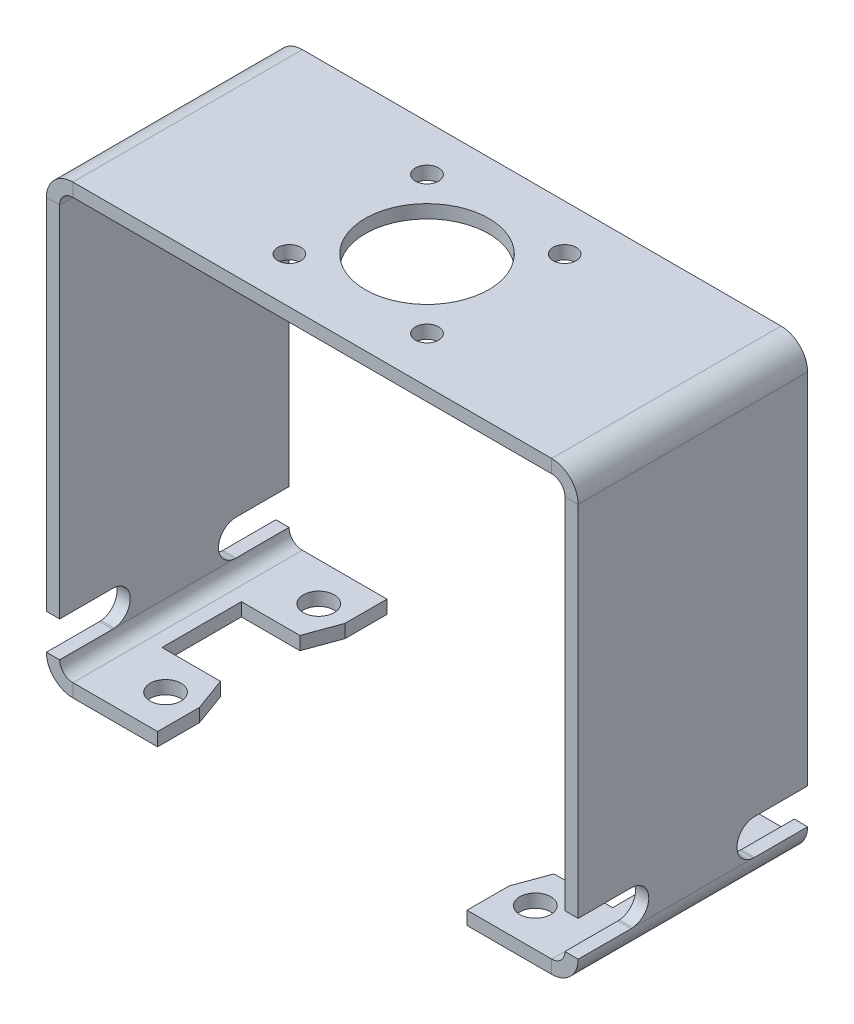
ISO-10303-21;
HEADER;
FILE_DESCRIPTION(('STEP AP214'),'2;1');
FILE_NAME('part.step','',(''),(''),'','','');
FILE_SCHEMA(('AUTOMOTIVE_DESIGN { 1 0 10303 214 1 1 1 1 }'));
ENDSEC;
DATA;
#1=APPLICATION_CONTEXT('core data for automotive mechanical design processes');
#2=APPLICATION_PROTOCOL_DEFINITION('international standard','automotive_design',2000,#1);
#3=PRODUCT_CONTEXT('',#1,'mechanical');
#4=PRODUCT('Part','Part','',(#3));
#5=PRODUCT_RELATED_PRODUCT_CATEGORY('part','',(#4));
#6=PRODUCT_DEFINITION_FORMATION('','',#4);
#7=PRODUCT_DEFINITION_CONTEXT('part definition',#1,'design');
#8=PRODUCT_DEFINITION('design','',#6,#7);
#9=PRODUCT_DEFINITION_SHAPE('','',#8);
#10=(LENGTH_UNIT() NAMED_UNIT(*) SI_UNIT(.MILLI.,.METRE.));
#11=(NAMED_UNIT(*) PLANE_ANGLE_UNIT() SI_UNIT($,.RADIAN.));
#12=(NAMED_UNIT(*) SI_UNIT($,.STERADIAN.) SOLID_ANGLE_UNIT());
#13=UNCERTAINTY_MEASURE_WITH_UNIT(LENGTH_MEASURE(1.E-05),#10,'distance_accuracy_value','');
#14=(GEOMETRIC_REPRESENTATION_CONTEXT(3) GLOBAL_UNCERTAINTY_ASSIGNED_CONTEXT((#13)) GLOBAL_UNIT_ASSIGNED_CONTEXT((#10,
#11,#12)) REPRESENTATION_CONTEXT('',''));
#15=CARTESIAN_POINT('',(0.,0.,0.));
#16=DIRECTION('',(0.,0.,1.));
#17=DIRECTION('',(1.,0.,0.));
#18=AXIS2_PLACEMENT_3D('',#15,#16,#17);
#19=CARTESIAN_POINT('',(-95.6818,-4.77519999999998,41.275));
#20=DIRECTION('',(1.,0.,0.));
#21=DIRECTION('',(0.,1.,0.));
#22=AXIS2_PLACEMENT_3D('',#19,#20,#21);
#23=PLANE('',#22);
#24=DIRECTION('',(0.,0.,1.));
#25=VECTOR('',#24,1.);
#26=CARTESIAN_POINT('',(-95.6818000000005,-138.56335,22.225));
#27=LINE('',#26,#25);
#28=CARTESIAN_POINT('',(-95.6818000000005,-138.56335,22.225));
#29=VERTEX_POINT('',#28);
#30=CARTESIAN_POINT('',(-95.6818000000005,-138.56335,41.275));
#31=VERTEX_POINT('',#30);
#32=EDGE_CURVE('E1899',#29,#31,#27,.T.);
#33=ORIENTED_EDGE('',*,*,#32,.T.);
#34=DIRECTION('',(0.,1.,0.));
#35=VECTOR('',#34,1.);
#36=CARTESIAN_POINT('',(-95.6818,-4.77519999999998,41.275));
#37=LINE('',#36,#35);
#38=CARTESIAN_POINT('',(-95.6818,-9.55039999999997,41.275));
#39=VERTEX_POINT('',#38);
#40=EDGE_CURVE('E457',#31,#39,#37,.T.);
#41=ORIENTED_EDGE('',*,*,#40,.T.);
#42=DIRECTION('',(0.,0.,-1.));
#43=VECTOR('',#42,1.);
#44=CARTESIAN_POINT('',(-95.6818,-9.55039999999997,41.275));
#45=LINE('',#44,#43);
#46=CARTESIAN_POINT('',(-95.6818,-9.55039999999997,-41.275));
#47=VERTEX_POINT('',#46);
#48=EDGE_CURVE('E464',#47,#39,#45,.F.);
#49=ORIENTED_EDGE('',*,*,#48,.F.);
#50=DIRECTION('',(0.,-1.,0.));
#51=VECTOR('',#50,1.);
#52=CARTESIAN_POINT('',(-95.6818,-4.77519999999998,-41.275));
#53=LINE('',#52,#51);
#54=CARTESIAN_POINT('',(-95.6818000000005,-138.56335,-41.275));
#55=VERTEX_POINT('',#54);
#56=EDGE_CURVE('E453',#47,#55,#53,.T.);
#57=ORIENTED_EDGE('',*,*,#56,.T.);
#58=DIRECTION('',(0.,0.,1.));
#59=VECTOR('',#58,1.);
#60=CARTESIAN_POINT('',(-95.6818000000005,-138.56335,41.275));
#61=LINE('',#60,#59);
#62=CARTESIAN_POINT('',(-95.6818000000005,-138.56335,-22.225));
#63=VERTEX_POINT('',#62);
#64=EDGE_CURVE('E887',#55,#63,#61,.T.);
#65=ORIENTED_EDGE('',*,*,#64,.T.);
#66=CARTESIAN_POINT('',(-95.6818000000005,-144.91335,-22.225));
#67=DIRECTION('',(1.,0.,0.));
#68=DIRECTION('',(0.,1.,0.));
#69=AXIS2_PLACEMENT_3D('',#66,#67,#68);
#70=CIRCLE('',#69,6.34999999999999);
#71=CARTESIAN_POINT('',(-95.6818000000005,-151.23795,-21.6576069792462));
#72=VERTEX_POINT('',#71);
#73=EDGE_CURVE('E1929',#63,#72,#70,.T.);
#74=ORIENTED_EDGE('',*,*,#73,.T.);
#75=DIRECTION('',(0.,0.,-1.));
#76=VECTOR('',#75,1.);
#77=CARTESIAN_POINT('',(-95.6818000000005,-151.23795,-41.275));
#78=LINE('',#77,#76);
#79=CARTESIAN_POINT('',(-95.6818000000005,-151.23795,21.6576069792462));
#80=VERTEX_POINT('',#79);
#81=EDGE_CURVE('E444',#72,#80,#78,.F.);
#82=ORIENTED_EDGE('',*,*,#81,.T.);
#83=CARTESIAN_POINT('',(-95.6818000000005,-144.91335,22.225));
#84=DIRECTION('',(1.,0.,0.));
#85=DIRECTION('',(0.,0.,-1.));
#86=AXIS2_PLACEMENT_3D('',#83,#84,#85);
#87=CIRCLE('',#86,6.34999999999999);
#88=EDGE_CURVE('E423',#80,#29,#87,.T.);
#89=ORIENTED_EDGE('',*,*,#88,.T.);
#90=EDGE_LOOP('',(#33,#41,#49,#57,#65,#74,#82,#89));
#91=FACE_BOUND('',#90,.T.);
#92=ADVANCED_FACE('F112',(#91),#23,.F.);
#93=CARTESIAN_POINT('',(-90.9066,-4.7752,41.275));
#94=DIRECTION('',(1.,0.,0.));
#95=DIRECTION('',(0.,1.,0.));
#96=AXIS2_PLACEMENT_3D('',#93,#94,#95);
#97=PLANE('',#96);
#98=DIRECTION('',(0.,-1.,0.));
#99=VECTOR('',#98,1.);
#100=CARTESIAN_POINT('',(-90.9066,-4.7752,41.275));
#101=LINE('',#100,#99);
#102=CARTESIAN_POINT('',(-90.9066000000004,-138.56335,41.275));
#103=VERTEX_POINT('',#102);
#104=CARTESIAN_POINT('',(-90.9066,-9.55039999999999,41.275));
#105=VERTEX_POINT('',#104);
#106=EDGE_CURVE('E462',#103,#105,#101,.F.);
#107=ORIENTED_EDGE('',*,*,#106,.F.);
#108=DIRECTION('',(0.,0.,1.));
#109=VECTOR('',#108,1.);
#110=CARTESIAN_POINT('',(-90.9066000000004,-138.56335,41.275));
#111=LINE('',#110,#109);
#112=CARTESIAN_POINT('',(-90.9066000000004,-138.56335,22.225));
#113=VERTEX_POINT('',#112);
#114=EDGE_CURVE('E1898',#113,#103,#111,.T.);
#115=ORIENTED_EDGE('',*,*,#114,.F.);
#116=CARTESIAN_POINT('',(-90.9066000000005,-144.91335,22.225));
#117=DIRECTION('',(1.,0.,0.));
#118=DIRECTION('',(0.,0.,-1.));
#119=AXIS2_PLACEMENT_3D('',#116,#117,#118);
#120=CIRCLE('',#119,6.34999999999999);
#121=CARTESIAN_POINT('',(-90.9066000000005,-151.23795,21.6576069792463));
#122=VERTEX_POINT('',#121);
#123=EDGE_CURVE('E1896',#122,#113,#120,.T.);
#124=ORIENTED_EDGE('',*,*,#123,.F.);
#125=DIRECTION('',(0.,0.,-1.));
#126=VECTOR('',#125,1.);
#127=CARTESIAN_POINT('',(-90.9066000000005,-151.23795,-41.275));
#128=LINE('',#127,#126);
#129=CARTESIAN_POINT('',(-90.9066000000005,-151.23795,-21.6576069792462));
#130=VERTEX_POINT('',#129);
#131=EDGE_CURVE('E441',#130,#122,#128,.F.);
#132=ORIENTED_EDGE('',*,*,#131,.F.);
#133=CARTESIAN_POINT('',(-90.9066000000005,-144.91335,-22.225));
#134=DIRECTION('',(1.,0.,0.));
#135=DIRECTION('',(0.,1.,0.));
#136=AXIS2_PLACEMENT_3D('',#133,#134,#135);
#137=CIRCLE('',#136,6.34999999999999);
#138=CARTESIAN_POINT('',(-90.9066000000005,-138.56335,-22.225));
#139=VERTEX_POINT('',#138);
#140=EDGE_CURVE('E1922',#139,#130,#137,.T.);
#141=ORIENTED_EDGE('',*,*,#140,.F.);
#142=DIRECTION('',(0.,0.,1.));
#143=VECTOR('',#142,1.);
#144=CARTESIAN_POINT('',(-90.9066000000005,-138.56335,41.275));
#145=LINE('',#144,#143);
#146=CARTESIAN_POINT('',(-90.9066000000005,-138.56335,-41.275));
#147=VERTEX_POINT('',#146);
#148=EDGE_CURVE('E1926',#147,#139,#145,.T.);
#149=ORIENTED_EDGE('',*,*,#148,.F.);
#150=DIRECTION('',(0.,1.,0.));
#151=VECTOR('',#150,1.);
#152=CARTESIAN_POINT('',(-90.9066000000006,-160.78835,-41.275));
#153=LINE('',#152,#151);
#154=CARTESIAN_POINT('',(-90.9066,-9.55039999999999,-41.275));
#155=VERTEX_POINT('',#154);
#156=EDGE_CURVE('E459',#155,#147,#153,.F.);
#157=ORIENTED_EDGE('',*,*,#156,.F.);
#158=DIRECTION('',(0.,0.,-1.));
#159=VECTOR('',#158,1.);
#160=CARTESIAN_POINT('',(-90.9066,-9.55039999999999,41.275));
#161=LINE('',#160,#159);
#162=EDGE_CURVE('E470',#105,#155,#161,.T.);
#163=ORIENTED_EDGE('',*,*,#162,.F.);
#164=EDGE_LOOP('',(#107,#115,#124,#132,#141,#149,#157,#163));
#165=FACE_BOUND('',#164,.T.);
#166=ADVANCED_FACE('F1043',(#165),#97,.T.);
#167=CARTESIAN_POINT('',(-86.1314000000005,-151.23795,-41.275));
#168=DIRECTION('',(0.,0.,-1.));
#169=DIRECTION('',(0.,-1.,0.));
#170=AXIS2_PLACEMENT_3D('',#167,#168,#169);
#171=CYLINDRICAL_SURFACE('',#170,9.55039999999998);
#172=CARTESIAN_POINT('',(-86.1314000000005,-151.23795,41.275));
#173=DIRECTION('',(0.,0.,-1.));
#174=DIRECTION('',(-1.,0.,0.));
#175=AXIS2_PLACEMENT_3D('',#172,#173,#174);
#176=CIRCLE('',#175,9.55039999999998);
#177=CARTESIAN_POINT('',(-95.6816648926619,-151.28875,41.275));
#178=VERTEX_POINT('',#177);
#179=CARTESIAN_POINT('',(-86.1314000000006,-160.78835,41.275));
#180=VERTEX_POINT('',#179);
#181=EDGE_CURVE('E475',#178,#180,#176,.F.);
#182=ORIENTED_EDGE('',*,*,#181,.F.);
#183=DIRECTION('',(0.,0.,-1.));
#184=VECTOR('',#183,1.);
#185=CARTESIAN_POINT('',(-95.6816648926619,-151.28875,-41.275));
#186=LINE('',#185,#184);
#187=CARTESIAN_POINT('',(-95.6816648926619,-151.28875,22.225));
#188=VERTEX_POINT('',#187);
#189=EDGE_CURVE('E127',#188,#178,#186,.F.);
#190=ORIENTED_EDGE('',*,*,#189,.F.);
#191=CARTESIAN_POINT('',(-95.6818000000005,-151.23795,21.6576069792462));
#192=CARTESIAN_POINT('',(-95.6817986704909,-151.246424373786,21.7048091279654));
#193=CARTESIAN_POINT('',(-95.6817883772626,-151.25385960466,21.7521964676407));
#194=CARTESIAN_POINT('',(-95.6817596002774,-151.26661997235,21.8472546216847));
#195=CARTESIAN_POINT('',(-95.6817411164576,-151.271945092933,21.8949254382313));
#196=CARTESIAN_POINT('',(-95.6816886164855,-151.284555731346,22.0365285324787));
#197=CARTESIAN_POINT('',(-95.681656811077,-151.288779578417,22.1307407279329));
#198=CARTESIAN_POINT('',(-95.6816648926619,-151.28875,22.225));
#199=B_SPLINE_CURVE_WITH_KNOTS('',3,(#191,#192,#193,#194,#195,#196,#197,#198),.UNSPECIFIED.,.F.,
.F.,(4,2,2,4),(0.,0.143855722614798,0.287712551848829,0.570297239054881),.UNSPECIFIED.);
#200=EDGE_CURVE('E434',#80,#188,#199,.T.);
#201=ORIENTED_EDGE('',*,*,#200,.F.);
#202=ORIENTED_EDGE('',*,*,#81,.F.);
#203=CARTESIAN_POINT('',(-95.6816648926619,-151.28875,-22.225));
#204=CARTESIAN_POINT('',(-95.6816634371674,-151.28875535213,-22.1769442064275));
#205=CARTESIAN_POINT('',(-95.6816703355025,-151.287662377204,-22.1288926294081));
#206=CARTESIAN_POINT('',(-95.6816930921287,-151.283302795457,-22.032888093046));
#207=CARTESIAN_POINT('',(-95.6817089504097,-151.280036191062,-21.9849351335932));
#208=CARTESIAN_POINT('',(-95.6817576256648,-151.2671998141,-21.8434464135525));
#209=CARTESIAN_POINT('',(-95.6817921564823,-151.25458965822,-21.7501774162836));
#210=CARTESIAN_POINT('',(-95.6818000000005,-151.23795,-21.6576069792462));
#211=B_SPLINE_CURVE_WITH_KNOTS('',3,(#203,#204,#205,#206,#207,#208,#209,#210),.UNSPECIFIED.,.F.,
.F.,(4,2,2,4),(0.,0.144146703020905,0.288293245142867,0.570300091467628),.UNSPECIFIED.);
#212=CARTESIAN_POINT('',(-95.6816648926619,-151.28875,-22.225));
#213=VERTEX_POINT('',#212);
#214=EDGE_CURVE('E872',#213,#72,#211,.T.);
#215=ORIENTED_EDGE('',*,*,#214,.F.);
#216=DIRECTION('',(0.,0.,-1.));
#217=VECTOR('',#216,1.);
#218=CARTESIAN_POINT('',(-95.6816648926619,-151.28875,-41.275));
#219=LINE('',#218,#217);
#220=CARTESIAN_POINT('',(-95.6816648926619,-151.28875,-41.275));
#221=VERTEX_POINT('',#220);
#222=EDGE_CURVE('E1935',#221,#213,#219,.F.);
#223=ORIENTED_EDGE('',*,*,#222,.F.);
#224=CARTESIAN_POINT('',(-86.1314000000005,-151.23795,-41.275));
#225=DIRECTION('',(0.,0.,-1.));
#226=DIRECTION('',(-1.,0.,0.));
#227=AXIS2_PLACEMENT_3D('',#224,#225,#226);
#228=CIRCLE('',#227,9.55039999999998);
#229=CARTESIAN_POINT('',(-86.1314000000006,-160.78835,-41.275));
#230=VERTEX_POINT('',#229);
#231=EDGE_CURVE('E440',#230,#221,#228,.T.);
#232=ORIENTED_EDGE('',*,*,#231,.F.);
#233=DIRECTION('',(0.,0.,-1.));
#234=VECTOR('',#233,1.);
#235=CARTESIAN_POINT('',(-86.1314000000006,-160.78835,41.275));
#236=LINE('',#235,#234);
#237=EDGE_CURVE('E587',#230,#180,#236,.F.);
#238=ORIENTED_EDGE('',*,*,#237,.T.);
#239=EDGE_LOOP('',(#182,#190,#201,#202,#215,#223,#232,#238));
#240=FACE_BOUND('',#239,.T.);
#241=ADVANCED_FACE('F599',(#240),#171,.T.);
#242=CARTESIAN_POINT('',(-86.1314000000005,-151.23795,-41.275));
#243=DIRECTION('',(0.,0.,-1.));
#244=DIRECTION('',(0.,-1.,0.));
#245=AXIS2_PLACEMENT_3D('',#242,#243,#244);
#246=CYLINDRICAL_SURFACE('',#245,4.77519999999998);
#247=DIRECTION('',(0.,0.,-1.));
#248=VECTOR('',#247,1.);
#249=CARTESIAN_POINT('',(-90.9065324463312,-151.26335,-41.275));
#250=LINE('',#249,#248);
#251=CARTESIAN_POINT('',(-90.9065324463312,-151.26335,22.225));
#252=VERTEX_POINT('',#251);
#253=CARTESIAN_POINT('',(-90.9065324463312,-151.26335,41.275));
#254=VERTEX_POINT('',#253);
#255=EDGE_CURVE('E418',#252,#254,#250,.F.);
#256=ORIENTED_EDGE('',*,*,#255,.T.);
#257=CARTESIAN_POINT('',(-86.1314000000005,-151.23795,41.275));
#258=DIRECTION('',(0.,0.,-1.));
#259=DIRECTION('',(-1.,0.,0.));
#260=AXIS2_PLACEMENT_3D('',#257,#258,#259);
#261=CIRCLE('',#260,4.77519999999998);
#262=CARTESIAN_POINT('',(-86.1314000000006,-156.01315,41.275));
#263=VERTEX_POINT('',#262);
#264=EDGE_CURVE('E429',#254,#263,#261,.F.);
#265=ORIENTED_EDGE('',*,*,#264,.T.);
#266=DIRECTION('',(0.,0.,-1.));
#267=VECTOR('',#266,1.);
#268=CARTESIAN_POINT('',(-86.1314000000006,-156.01315,41.275));
#269=LINE('',#268,#267);
#270=CARTESIAN_POINT('',(-86.1314000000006,-156.01315,-41.275));
#271=VERTEX_POINT('',#270);
#272=EDGE_CURVE('E593',#263,#271,#269,.T.);
#273=ORIENTED_EDGE('',*,*,#272,.T.);
#274=CARTESIAN_POINT('',(-86.1314000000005,-151.23795,-41.275));
#275=DIRECTION('',(0.,0.,-1.));
#276=DIRECTION('',(-1.,0.,0.));
#277=AXIS2_PLACEMENT_3D('',#274,#275,#276);
#278=CIRCLE('',#277,4.77519999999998);
#279=CARTESIAN_POINT('',(-90.9065324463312,-151.26335,-41.275));
#280=VERTEX_POINT('',#279);
#281=EDGE_CURVE('E446',#271,#280,#278,.T.);
#282=ORIENTED_EDGE('',*,*,#281,.T.);
#283=DIRECTION('',(0.,0.,-1.));
#284=VECTOR('',#283,1.);
#285=CARTESIAN_POINT('',(-90.9065324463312,-151.26335,-41.275));
#286=LINE('',#285,#284);
#287=CARTESIAN_POINT('',(-90.9065324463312,-151.26335,-22.225));
#288=VERTEX_POINT('',#287);
#289=EDGE_CURVE('E885',#280,#288,#286,.F.);
#290=ORIENTED_EDGE('',*,*,#289,.T.);
#291=CARTESIAN_POINT('',(-90.9065324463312,-151.26335,-22.225));
#292=CARTESIAN_POINT('',(-90.9065317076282,-151.263350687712,-22.1769588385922));
#293=CARTESIAN_POINT('',(-90.9065351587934,-151.262806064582,-22.128918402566));
#294=CARTESIAN_POINT('',(-90.9065465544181,-151.260626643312,-22.0328622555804));
#295=CARTESIAN_POINT('',(-90.9065544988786,-151.258991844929,-21.9848465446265));
#296=CARTESIAN_POINT('',(-90.9065787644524,-151.252579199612,-21.8436532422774));
#297=CARTESIAN_POINT('',(-90.9065959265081,-151.24629125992,-21.7505421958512));
#298=CARTESIAN_POINT('',(-90.9066000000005,-151.23795,-21.6576069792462));
#299=B_SPLINE_CURVE_WITH_KNOTS('',3,(#291,#292,#293,#294,#295,#296,#297,#298),.UNSPECIFIED.,.F.,
.F.,(4,2,2,4),(0.,0.14411892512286,0.288237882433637,0.568122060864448),.UNSPECIFIED.);
#300=EDGE_CURVE('E879',#288,#130,#299,.T.);
#301=ORIENTED_EDGE('',*,*,#300,.T.);
#302=ORIENTED_EDGE('',*,*,#131,.T.);
#303=CARTESIAN_POINT('',(-90.9066000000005,-151.23795,21.6576069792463));
#304=CARTESIAN_POINT('',(-90.906599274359,-151.24223471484,21.7053600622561));
#305=CARTESIAN_POINT('',(-90.906594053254,-151.245978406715,21.7531609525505));
#306=CARTESIAN_POINT('',(-90.9065795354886,-151.252382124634,21.8488352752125));
#307=CARTESIAN_POINT('',(-90.9065702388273,-151.25504215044,21.8967087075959));
#308=CARTESIAN_POINT('',(-90.9065440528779,-151.261288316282,22.0380057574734));
#309=CARTESIAN_POINT('',(-90.9065283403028,-151.263353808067,22.1314986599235));
#310=CARTESIAN_POINT('',(-90.9065324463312,-151.26335,22.225));
#311=B_SPLINE_CURVE_WITH_KNOTS('',3,(#303,#304,#305,#306,#307,#308,#309,#310),.UNSPECIFIED.,.F.,
.F.,(4,2,2,4),(0.,0.143830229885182,0.287660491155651,0.56812195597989),.UNSPECIFIED.);
#312=EDGE_CURVE('E433',#122,#252,#311,.T.);
#313=ORIENTED_EDGE('',*,*,#312,.T.);
#314=EDGE_LOOP('',(#256,#265,#273,#282,#290,#301,#302,#313));
#315=FACE_BOUND('',#314,.T.);
#316=ADVANCED_FACE('F428',(#315),#246,.F.);
#317=CARTESIAN_POINT('',(-95.6818,-4.77519999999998,41.275));
#318=DIRECTION('',(0.,0.,-1.));
#319=DIRECTION('',(0.,1.,0.));
#320=AXIS2_PLACEMENT_3D('',#317,#318,#319);
#321=PLANE('',#320);
#322=DIRECTION('',(-1.,0.,0.));
#323=VECTOR('',#322,1.);
#324=CARTESIAN_POINT('',(-95.6818000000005,-138.56335,41.275));
#325=LINE('',#324,#323);
#326=EDGE_CURVE('E1838',#31,#103,#325,.F.);
#327=ORIENTED_EDGE('',*,*,#326,.T.);
#328=ORIENTED_EDGE('',*,*,#106,.T.);
#329=DIRECTION('',(1.,0.,0.));
#330=VECTOR('',#329,1.);
#331=CARTESIAN_POINT('',(-95.6818,-9.55039999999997,41.275));
#332=LINE('',#331,#330);
#333=EDGE_CURVE('E472',#105,#39,#332,.F.);
#334=ORIENTED_EDGE('',*,*,#333,.T.);
#335=ORIENTED_EDGE('',*,*,#40,.F.);
#336=EDGE_LOOP('',(#327,#328,#334,#335));
#337=FACE_BOUND('',#336,.T.);
#338=ADVANCED_FACE('F1046',(#337),#321,.F.);
#339=CARTESIAN_POINT('',(-86.1314000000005,-151.23795,41.275));
#340=DIRECTION('',(0.,0.,1.));
#341=DIRECTION('',(1.,0.,0.));
#342=AXIS2_PLACEMENT_3D('',#339,#340,#341);
#343=PLANE('',#342);
#344=ORIENTED_EDGE('',*,*,#264,.F.);
#345=DIRECTION('',(0.999985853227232,0.00531914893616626,0.));
#346=VECTOR('',#345,1.);
#347=CARTESIAN_POINT('',(-90.9065324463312,-151.26335,41.275));
#348=LINE('',#347,#346);
#349=EDGE_CURVE('E415',#254,#178,#348,.F.);
#350=ORIENTED_EDGE('',*,*,#349,.T.);
#351=ORIENTED_EDGE('',*,*,#181,.T.);
#352=DIRECTION('',(0.,1.,0.));
#353=VECTOR('',#352,1.);
#354=CARTESIAN_POINT('',(-86.1314000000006,-160.78835,41.275));
#355=LINE('',#354,#353);
#356=EDGE_CURVE('E438',#263,#180,#355,.F.);
#357=ORIENTED_EDGE('',*,*,#356,.F.);
#358=EDGE_LOOP('',(#344,#350,#351,#357));
#359=FACE_BOUND('',#358,.T.);
#360=ADVANCED_FACE('F436',(#359),#343,.T.);
#361=CARTESIAN_POINT('',(95.6818,-4.77519999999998,41.275));
#362=DIRECTION('',(-1.,0.,0.));
#363=DIRECTION('',(0.,1.,0.));
#364=AXIS2_PLACEMENT_3D('',#361,#362,#363);
#365=PLANE('',#364);
#366=DIRECTION('',(0.,0.,1.));
#367=VECTOR('',#366,1.);
#368=CARTESIAN_POINT('',(95.6818000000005,-138.56335,-22.225));
#369=LINE('',#368,#367);
#370=CARTESIAN_POINT('',(95.6818000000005,-138.56335,-41.275));
#371=VERTEX_POINT('',#370);
#372=CARTESIAN_POINT('',(95.6818000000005,-138.56335,-22.225));
#373=VERTEX_POINT('',#372);
#374=EDGE_CURVE('E1964',#371,#373,#369,.T.);
#375=ORIENTED_EDGE('',*,*,#374,.F.);
#376=DIRECTION('',(0.,1.,0.));
#377=VECTOR('',#376,1.);
#378=CARTESIAN_POINT('',(95.6818000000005,-160.78835,-41.275));
#379=LINE('',#378,#377);
#380=CARTESIAN_POINT('',(95.6818,-9.55039999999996,-41.275));
#381=VERTEX_POINT('',#380);
#382=EDGE_CURVE('E746',#381,#371,#379,.F.);
#383=ORIENTED_EDGE('',*,*,#382,.F.);
#384=DIRECTION('',(0.,0.,1.));
#385=VECTOR('',#384,1.);
#386=CARTESIAN_POINT('',(95.6818,-9.55039999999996,-41.275));
#387=LINE('',#386,#385);
#388=CARTESIAN_POINT('',(95.6818,-9.55039999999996,41.275));
#389=VERTEX_POINT('',#388);
#390=EDGE_CURVE('E757',#389,#381,#387,.F.);
#391=ORIENTED_EDGE('',*,*,#390,.F.);
#392=DIRECTION('',(0.,-1.,0.));
#393=VECTOR('',#392,1.);
#394=CARTESIAN_POINT('',(95.6818,-4.77519999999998,41.275));
#395=LINE('',#394,#393);
#396=CARTESIAN_POINT('',(95.6818000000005,-138.56335,41.275));
#397=VERTEX_POINT('',#396);
#398=EDGE_CURVE('E750',#397,#389,#395,.F.);
#399=ORIENTED_EDGE('',*,*,#398,.F.);
#400=DIRECTION('',(0.,0.,-1.));
#401=VECTOR('',#400,1.);
#402=CARTESIAN_POINT('',(95.6818000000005,-138.56335,41.275));
#403=LINE('',#402,#401);
#404=CARTESIAN_POINT('',(95.6818000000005,-138.56335,22.225));
#405=VERTEX_POINT('',#404);
#406=EDGE_CURVE('E1950',#397,#405,#403,.T.);
#407=ORIENTED_EDGE('',*,*,#406,.T.);
#408=CARTESIAN_POINT('',(95.6818000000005,-144.91335,22.225));
#409=DIRECTION('',(-1.,0.,0.));
#410=DIRECTION('',(0.,-1.,0.));
#411=AXIS2_PLACEMENT_3D('',#408,#409,#410);
#412=CIRCLE('',#411,6.34999999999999);
#413=CARTESIAN_POINT('',(95.6818000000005,-151.23795,21.6576069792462));
#414=VERTEX_POINT('',#413);
#415=EDGE_CURVE('E1943',#405,#414,#412,.T.);
#416=ORIENTED_EDGE('',*,*,#415,.T.);
#417=DIRECTION('',(0.,0.,1.));
#418=VECTOR('',#417,1.);
#419=CARTESIAN_POINT('',(95.6818000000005,-151.23795,41.275));
#420=LINE('',#419,#418);
#421=CARTESIAN_POINT('',(95.6818000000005,-151.23795,-21.6576069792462));
#422=VERTEX_POINT('',#421);
#423=EDGE_CURVE('E730',#414,#422,#420,.F.);
#424=ORIENTED_EDGE('',*,*,#423,.T.);
#425=CARTESIAN_POINT('',(95.6818000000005,-144.91335,-22.225));
#426=DIRECTION('',(1.,0.,0.));
#427=DIRECTION('',(0.,0.,1.));
#428=AXIS2_PLACEMENT_3D('',#425,#426,#427);
#429=CIRCLE('',#428,6.34999999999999);
#430=EDGE_CURVE('E1849',#373,#422,#429,.T.);
#431=ORIENTED_EDGE('',*,*,#430,.F.);
#432=EDGE_LOOP('',(#375,#383,#391,#399,#407,#416,#424,#431));
#433=FACE_BOUND('',#432,.T.);
#434=ADVANCED_FACE('F1004',(#433),#365,.F.);
#435=CARTESIAN_POINT('',(90.9066,-4.7752,41.275));
#436=DIRECTION('',(-1.,0.,0.));
#437=DIRECTION('',(0.,1.,0.));
#438=AXIS2_PLACEMENT_3D('',#435,#436,#437);
#439=PLANE('',#438);
#440=DIRECTION('',(0.,-1.,0.));
#441=VECTOR('',#440,1.);
#442=CARTESIAN_POINT('',(90.9066,-4.7752,-41.275));
#443=LINE('',#442,#441);
#444=CARTESIAN_POINT('',(90.9066,-9.55039999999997,-41.275));
#445=VERTEX_POINT('',#444);
#446=CARTESIAN_POINT('',(90.9066000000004,-138.56335,-41.275));
#447=VERTEX_POINT('',#446);
#448=EDGE_CURVE('E752',#445,#447,#443,.T.);
#449=ORIENTED_EDGE('',*,*,#448,.T.);
#450=DIRECTION('',(0.,0.,-1.));
#451=VECTOR('',#450,1.);
#452=CARTESIAN_POINT('',(90.9066000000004,-138.56335,41.275));
#453=LINE('',#452,#451);
#454=CARTESIAN_POINT('',(90.9066000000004,-138.56335,-22.225));
#455=VERTEX_POINT('',#454);
#456=EDGE_CURVE('E818',#447,#455,#453,.F.);
#457=ORIENTED_EDGE('',*,*,#456,.T.);
#458=CARTESIAN_POINT('',(90.9066000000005,-144.91335,-22.225));
#459=DIRECTION('',(1.,0.,0.));
#460=DIRECTION('',(0.,0.,-1.));
#461=AXIS2_PLACEMENT_3D('',#458,#459,#460);
#462=CIRCLE('',#461,6.34999999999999);
#463=CARTESIAN_POINT('',(90.9066000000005,-151.23795,-21.6576069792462));
#464=VERTEX_POINT('',#463);
#465=EDGE_CURVE('E1959',#455,#464,#462,.T.);
#466=ORIENTED_EDGE('',*,*,#465,.T.);
#467=DIRECTION('',(0.,0.,1.));
#468=VECTOR('',#467,1.);
#469=CARTESIAN_POINT('',(90.9066000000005,-151.23795,41.275));
#470=LINE('',#469,#468);
#471=CARTESIAN_POINT('',(90.9066000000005,-151.23795,21.6576069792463));
#472=VERTEX_POINT('',#471);
#473=EDGE_CURVE('E741',#472,#464,#470,.F.);
#474=ORIENTED_EDGE('',*,*,#473,.F.);
#475=CARTESIAN_POINT('',(90.9066000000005,-144.91335,22.225));
#476=DIRECTION('',(-1.,0.,0.));
#477=DIRECTION('',(0.,-1.,0.));
#478=AXIS2_PLACEMENT_3D('',#475,#476,#477);
#479=CIRCLE('',#478,6.34999999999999);
#480=CARTESIAN_POINT('',(90.9066000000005,-138.56335,22.225));
#481=VERTEX_POINT('',#480);
#482=EDGE_CURVE('E1947',#481,#472,#479,.T.);
#483=ORIENTED_EDGE('',*,*,#482,.F.);
#484=DIRECTION('',(0.,0.,-1.));
#485=VECTOR('',#484,1.);
#486=CARTESIAN_POINT('',(90.9066000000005,-138.56335,41.275));
#487=LINE('',#486,#485);
#488=CARTESIAN_POINT('',(90.9066000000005,-138.56335,41.275));
#489=VERTEX_POINT('',#488);
#490=EDGE_CURVE('E827',#489,#481,#487,.T.);
#491=ORIENTED_EDGE('',*,*,#490,.F.);
#492=DIRECTION('',(0.,1.,0.));
#493=VECTOR('',#492,1.);
#494=CARTESIAN_POINT('',(90.9066,-4.7752,41.275));
#495=LINE('',#494,#493);
#496=CARTESIAN_POINT('',(90.9066,-9.55039999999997,41.275));
#497=VERTEX_POINT('',#496);
#498=EDGE_CURVE('E755',#489,#497,#495,.T.);
#499=ORIENTED_EDGE('',*,*,#498,.T.);
#500=DIRECTION('',(0.,0.,1.));
#501=VECTOR('',#500,1.);
#502=CARTESIAN_POINT('',(90.9066,-9.55039999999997,-41.275));
#503=LINE('',#502,#501);
#504=EDGE_CURVE('E762',#445,#497,#503,.T.);
#505=ORIENTED_EDGE('',*,*,#504,.F.);
#506=EDGE_LOOP('',(#449,#457,#466,#474,#483,#491,#499,#505));
#507=FACE_BOUND('',#506,.T.);
#508=ADVANCED_FACE('F795',(#507),#439,.T.);
#509=CARTESIAN_POINT('',(86.1314000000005,-151.23795,41.275));
#510=DIRECTION('',(0.,0.,1.));
#511=DIRECTION('',(0.,-1.,0.));
#512=AXIS2_PLACEMENT_3D('',#509,#510,#511);
#513=CYLINDRICAL_SURFACE('',#512,9.55039999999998);
#514=CARTESIAN_POINT('',(86.1314000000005,-151.23795,-41.275));
#515=DIRECTION('',(0.,0.,1.));
#516=DIRECTION('',(1.,0.,0.));
#517=AXIS2_PLACEMENT_3D('',#514,#515,#516);
#518=CIRCLE('',#517,9.55039999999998);
#519=CARTESIAN_POINT('',(95.6816648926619,-151.28875,-41.275));
#520=VERTEX_POINT('',#519);
#521=CARTESIAN_POINT('',(86.1314000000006,-160.78835,-41.275));
#522=VERTEX_POINT('',#521);
#523=EDGE_CURVE('E733',#520,#522,#518,.F.);
#524=ORIENTED_EDGE('',*,*,#523,.F.);
#525=DIRECTION('',(0.,0.,1.));
#526=VECTOR('',#525,1.);
#527=CARTESIAN_POINT('',(95.6816648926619,-151.28875,41.275));
#528=LINE('',#527,#526);
#529=CARTESIAN_POINT('',(95.6816648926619,-151.28875,-22.225));
#530=VERTEX_POINT('',#529);
#531=EDGE_CURVE('E135',#530,#520,#528,.F.);
#532=ORIENTED_EDGE('',*,*,#531,.F.);
#533=CARTESIAN_POINT('',(95.6818000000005,-151.23795,-21.6576069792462));
#534=CARTESIAN_POINT('',(95.6817986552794,-151.246456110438,-21.7049854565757));
#535=CARTESIAN_POINT('',(95.681788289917,-151.253915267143,-21.7525505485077));
#536=CARTESIAN_POINT('',(95.6817593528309,-151.266707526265,-21.8479659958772));
#537=CARTESIAN_POINT('',(95.681740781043,-151.2720406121,-21.8958163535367));
#538=CARTESIAN_POINT('',(95.6816884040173,-151.284587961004,-22.0372455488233));
#539=CARTESIAN_POINT('',(95.6816568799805,-151.288779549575,-22.1310996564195));
#540=CARTESIAN_POINT('',(95.6816648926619,-151.28875,-22.225));
#541=B_SPLINE_CURVE_WITH_KNOTS('',3,(#533,#534,#535,#536,#537,#538,#539,#540),.UNSPECIFIED.,.F.,
.F.,(4,2,2,4),(0.,0.144393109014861,0.288787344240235,0.570298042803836),.UNSPECIFIED.);
#542=EDGE_CURVE('E1852',#422,#530,#541,.T.);
#543=ORIENTED_EDGE('',*,*,#542,.F.);
#544=ORIENTED_EDGE('',*,*,#423,.F.);
#545=CARTESIAN_POINT('',(95.6816648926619,-151.28875,22.225));
#546=CARTESIAN_POINT('',(95.6816634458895,-151.288755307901,22.1770405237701));
#547=CARTESIAN_POINT('',(95.6816703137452,-151.28766670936,22.1290852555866));
#548=CARTESIAN_POINT('',(95.6816929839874,-151.283324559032,22.0332727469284));
#549=CARTESIAN_POINT('',(95.681708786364,-151.280071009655,21.9854155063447));
#550=CARTESIAN_POINT('',(95.6817574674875,-151.267251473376,21.843828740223));
#551=CARTESIAN_POINT('',(95.6817921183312,-151.254623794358,21.7503672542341));
#552=CARTESIAN_POINT('',(95.6818000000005,-151.23795,21.6576069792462));
#553=B_SPLINE_CURVE_WITH_KNOTS('',3,(#545,#546,#547,#548,#549,#550,#551,#552),.UNSPECIFIED.,.F.,
.F.,(4,2,2,4),(0.,0.14385784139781,0.287715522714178,0.570299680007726),.UNSPECIFIED.);
#554=CARTESIAN_POINT('',(95.6816648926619,-151.28875,22.225));
#555=VERTEX_POINT('',#554);
#556=EDGE_CURVE('E820',#555,#414,#553,.T.);
#557=ORIENTED_EDGE('',*,*,#556,.F.);
#558=DIRECTION('',(0.,0.,1.));
#559=VECTOR('',#558,1.);
#560=CARTESIAN_POINT('',(95.6816648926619,-151.28875,41.275));
#561=LINE('',#560,#559);
#562=CARTESIAN_POINT('',(95.6816648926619,-151.28875,41.275));
#563=VERTEX_POINT('',#562);
#564=EDGE_CURVE('E819',#563,#555,#561,.F.);
#565=ORIENTED_EDGE('',*,*,#564,.F.);
#566=CARTESIAN_POINT('',(86.1314000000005,-151.23795,41.275));
#567=DIRECTION('',(0.,0.,1.));
#568=DIRECTION('',(1.,0.,0.));
#569=AXIS2_PLACEMENT_3D('',#566,#567,#568);
#570=CIRCLE('',#569,9.55039999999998);
#571=CARTESIAN_POINT('',(86.1314000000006,-160.78835,41.275));
#572=VERTEX_POINT('',#571);
#573=EDGE_CURVE('E734',#572,#563,#570,.T.);
#574=ORIENTED_EDGE('',*,*,#573,.F.);
#575=DIRECTION('',(0.,0.,1.));
#576=VECTOR('',#575,1.);
#577=CARTESIAN_POINT('',(86.1314000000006,-160.78835,-41.275));
#578=LINE('',#577,#576);
#579=EDGE_CURVE('E720',#572,#522,#578,.F.);
#580=ORIENTED_EDGE('',*,*,#579,.T.);
#581=EDGE_LOOP('',(#524,#532,#543,#544,#557,#565,#574,#580));
#582=FACE_BOUND('',#581,.T.);
#583=ADVANCED_FACE('F987',(#582),#513,.T.);
#584=CARTESIAN_POINT('',(86.1314000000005,-151.23795,41.275));
#585=DIRECTION('',(0.,0.,1.));
#586=DIRECTION('',(0.,-1.,0.));
#587=AXIS2_PLACEMENT_3D('',#584,#585,#586);
#588=CYLINDRICAL_SURFACE('',#587,4.77519999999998);
#589=DIRECTION('',(0.,0.,1.));
#590=VECTOR('',#589,1.);
#591=CARTESIAN_POINT('',(90.9065324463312,-151.26335,41.275));
#592=LINE('',#591,#590);
#593=CARTESIAN_POINT('',(90.9065324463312,-151.26335,-22.225));
#594=VERTEX_POINT('',#593);
#595=CARTESIAN_POINT('',(90.9065324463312,-151.26335,-41.275));
#596=VERTEX_POINT('',#595);
#597=EDGE_CURVE('E1835',#594,#596,#592,.F.);
#598=ORIENTED_EDGE('',*,*,#597,.T.);
#599=CARTESIAN_POINT('',(86.1314000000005,-151.23795,-41.275));
#600=DIRECTION('',(0.,0.,1.));
#601=DIRECTION('',(1.,0.,0.));
#602=AXIS2_PLACEMENT_3D('',#599,#600,#601);
#603=CIRCLE('',#602,4.77519999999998);
#604=CARTESIAN_POINT('',(86.1314000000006,-156.01315,-41.275));
#605=VERTEX_POINT('',#604);
#606=EDGE_CURVE('E739',#596,#605,#603,.F.);
#607=ORIENTED_EDGE('',*,*,#606,.T.);
#608=DIRECTION('',(0.,0.,1.));
#609=VECTOR('',#608,1.);
#610=CARTESIAN_POINT('',(86.1314000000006,-156.01315,-41.275));
#611=LINE('',#610,#609);
#612=CARTESIAN_POINT('',(86.1314000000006,-156.01315,41.275));
#613=VERTEX_POINT('',#612);
#614=EDGE_CURVE('E726',#605,#613,#611,.T.);
#615=ORIENTED_EDGE('',*,*,#614,.T.);
#616=CARTESIAN_POINT('',(86.1314000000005,-151.23795,41.275));
#617=DIRECTION('',(0.,0.,1.));
#618=DIRECTION('',(1.,0.,0.));
#619=AXIS2_PLACEMENT_3D('',#616,#617,#618);
#620=CIRCLE('',#619,4.77519999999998);
#621=CARTESIAN_POINT('',(90.9065324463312,-151.26335,41.275));
#622=VERTEX_POINT('',#621);
#623=EDGE_CURVE('E698',#613,#622,#620,.T.);
#624=ORIENTED_EDGE('',*,*,#623,.T.);
#625=DIRECTION('',(0.,0.,1.));
#626=VECTOR('',#625,1.);
#627=CARTESIAN_POINT('',(90.9065324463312,-151.26335,41.275));
#628=LINE('',#627,#626);
#629=CARTESIAN_POINT('',(90.9065324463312,-151.26335,22.225));
#630=VERTEX_POINT('',#629);
#631=EDGE_CURVE('E805',#622,#630,#628,.F.);
#632=ORIENTED_EDGE('',*,*,#631,.T.);
#633=CARTESIAN_POINT('',(90.9065324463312,-151.26335,22.225));
#634=CARTESIAN_POINT('',(90.9065317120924,-151.263350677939,22.1770550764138));
#635=CARTESIAN_POINT('',(90.9065351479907,-151.262808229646,22.1291108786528));
#636=CARTESIAN_POINT('',(90.9065465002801,-151.260637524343,22.0332470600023));
#637=CARTESIAN_POINT('',(90.9065544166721,-151.259009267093,21.9853274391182));
#638=CARTESIAN_POINT('',(90.906578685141,-151.252605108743,21.8440374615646));
#639=CARTESIAN_POINT('',(90.9065959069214,-151.246308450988,21.750733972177));
#640=CARTESIAN_POINT('',(90.9066000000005,-151.23795,21.6576069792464));
#641=B_SPLINE_CURVE_WITH_KNOTS('',3,(#633,#634,#635,#636,#637,#638,#639,#640),.UNSPECIFIED.,.F.,
.F.,(4,2,2,4),(0.,0.143830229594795,0.287660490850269,0.568121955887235),.UNSPECIFIED.);
#642=EDGE_CURVE('E809',#630,#472,#641,.T.);
#643=ORIENTED_EDGE('',*,*,#642,.T.);
#644=ORIENTED_EDGE('',*,*,#473,.T.);
#645=CARTESIAN_POINT('',(90.9066000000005,-151.23795,-21.6576069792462));
#646=CARTESIAN_POINT('',(90.90659926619,-151.242250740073,-21.7055383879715));
#647=CARTESIAN_POINT('',(90.9065940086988,-151.246006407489,-21.753517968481));
#648=CARTESIAN_POINT('',(90.9065794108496,-151.252425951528,-21.8495501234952));
#649=CARTESIAN_POINT('',(90.9065700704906,-151.255089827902,-21.8976026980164));
#650=CARTESIAN_POINT('',(90.9065439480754,-151.261304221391,-22.0387220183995));
#651=CARTESIAN_POINT('',(90.9065283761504,-151.263353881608,-22.1318568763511));
#652=CARTESIAN_POINT('',(90.9065324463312,-151.26335,-22.225));
#653=B_SPLINE_CURVE_WITH_KNOTS('',3,(#645,#646,#647,#648,#649,#650,#651,#652),.UNSPECIFIED.,.F.,
.F.,(4,2,2,4),(0.,0.144367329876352,0.288734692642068,0.568122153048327),.UNSPECIFIED.);
#654=EDGE_CURVE('E1836',#464,#594,#653,.T.);
#655=ORIENTED_EDGE('',*,*,#654,.T.);
#656=EDGE_LOOP('',(#598,#607,#615,#624,#632,#643,#644,#655));
#657=FACE_BOUND('',#656,.T.);
#658=ADVANCED_FACE('F990',(#657),#588,.F.);
#659=CARTESIAN_POINT('',(95.6818000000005,-160.78835,-41.275));
#660=DIRECTION('',(0.,0.,-1.));
#661=DIRECTION('',(-1.,0.,0.));
#662=AXIS2_PLACEMENT_3D('',#659,#660,#661);
#663=PLANE('',#662);
#664=ORIENTED_EDGE('',*,*,#382,.T.);
#665=DIRECTION('',(1.,0.,0.));
#666=VECTOR('',#665,1.);
#667=CARTESIAN_POINT('',(95.6818000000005,-138.56335,-41.275));
#668=LINE('',#667,#666);
#669=EDGE_CURVE('E802',#371,#447,#668,.F.);
#670=ORIENTED_EDGE('',*,*,#669,.T.);
#671=ORIENTED_EDGE('',*,*,#448,.F.);
#672=DIRECTION('',(1.,0.,0.));
#673=VECTOR('',#672,1.);
#674=CARTESIAN_POINT('',(95.6818,-9.55039999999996,-41.275));
#675=LINE('',#674,#673);
#676=EDGE_CURVE('E736',#445,#381,#675,.T.);
#677=ORIENTED_EDGE('',*,*,#676,.T.);
#678=EDGE_LOOP('',(#664,#670,#671,#677));
#679=FACE_BOUND('',#678,.T.);
#680=ADVANCED_FACE('F800',(#679),#663,.T.);
#681=CARTESIAN_POINT('',(86.1314000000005,-151.23795,-41.275));
#682=DIRECTION('',(0.,0.,-1.));
#683=DIRECTION('',(-1.,0.,0.));
#684=AXIS2_PLACEMENT_3D('',#681,#682,#683);
#685=PLANE('',#684);
#686=ORIENTED_EDGE('',*,*,#606,.F.);
#687=DIRECTION('',(-0.999985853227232,0.00531914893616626,0.));
#688=VECTOR('',#687,1.);
#689=CARTESIAN_POINT('',(90.9065324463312,-151.26335,-41.275));
#690=LINE('',#689,#688);
#691=EDGE_CURVE('E1847',#596,#520,#690,.F.);
#692=ORIENTED_EDGE('',*,*,#691,.T.);
#693=ORIENTED_EDGE('',*,*,#523,.T.);
#694=DIRECTION('',(0.,-1.,0.));
#695=VECTOR('',#694,1.);
#696=CARTESIAN_POINT('',(86.1314000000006,-160.78835,-41.275));
#697=LINE('',#696,#695);
#698=EDGE_CURVE('E694',#605,#522,#697,.T.);
#699=ORIENTED_EDGE('',*,*,#698,.F.);
#700=EDGE_LOOP('',(#686,#692,#693,#699));
#701=FACE_BOUND('',#700,.T.);
#702=ADVANCED_FACE('F995',(#701),#685,.T.);
#703=CARTESIAN_POINT('',(95.6818,-4.77519999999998,41.275));
#704=DIRECTION('',(0.,0.,1.));
#705=DIRECTION('',(0.,-1.,0.));
#706=AXIS2_PLACEMENT_3D('',#703,#704,#705);
#707=PLANE('',#706);
#708=ORIENTED_EDGE('',*,*,#498,.F.);
#709=DIRECTION('',(-1.,0.,0.));
#710=VECTOR('',#709,1.);
#711=CARTESIAN_POINT('',(90.9066000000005,-138.56335,41.275));
#712=LINE('',#711,#710);
#713=EDGE_CURVE('E786',#489,#397,#712,.F.);
#714=ORIENTED_EDGE('',*,*,#713,.T.);
#715=ORIENTED_EDGE('',*,*,#398,.T.);
#716=DIRECTION('',(1.,0.,0.));
#717=VECTOR('',#716,1.);
#718=CARTESIAN_POINT('',(90.9066,-9.55039999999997,41.275));
#719=LINE('',#718,#717);
#720=EDGE_CURVE('E759',#497,#389,#719,.T.);
#721=ORIENTED_EDGE('',*,*,#720,.F.);
#722=EDGE_LOOP('',(#708,#714,#715,#721));
#723=FACE_BOUND('',#722,.T.);
#724=ADVANCED_FACE('F782',(#723),#707,.T.);
#725=CARTESIAN_POINT('',(86.1314000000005,-151.23795,41.275));
#726=DIRECTION('',(0.,0.,-1.));
#727=DIRECTION('',(-1.,0.,0.));
#728=AXIS2_PLACEMENT_3D('',#725,#726,#727);
#729=PLANE('',#728);
#730=ORIENTED_EDGE('',*,*,#573,.T.);
#731=DIRECTION('',(-0.999985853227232,0.00531914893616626,0.));
#732=VECTOR('',#731,1.);
#733=CARTESIAN_POINT('',(90.9065324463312,-151.26335,41.275));
#734=LINE('',#733,#732);
#735=EDGE_CURVE('E822',#622,#563,#734,.F.);
#736=ORIENTED_EDGE('',*,*,#735,.F.);
#737=ORIENTED_EDGE('',*,*,#623,.F.);
#738=DIRECTION('',(0.,-1.,0.));
#739=VECTOR('',#738,1.);
#740=CARTESIAN_POINT('',(86.1314000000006,-156.01315,41.275));
#741=LINE('',#740,#739);
#742=EDGE_CURVE('E723',#613,#572,#741,.T.);
#743=ORIENTED_EDGE('',*,*,#742,.T.);
#744=EDGE_LOOP('',(#730,#736,#737,#743));
#745=FACE_BOUND('',#744,.T.);
#746=ADVANCED_FACE('F999',(#745),#729,.F.);
#747=CARTESIAN_POINT('',(-95.6818000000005,-160.78835,-41.275));
#748=DIRECTION('',(0.,0.,1.));
#749=DIRECTION('',(1.,0.,0.));
#750=AXIS2_PLACEMENT_3D('',#747,#748,#749);
#751=PLANE('',#750);
#752=DIRECTION('',(1.,0.,0.));
#753=VECTOR('',#752,1.);
#754=CARTESIAN_POINT('',(-90.9066000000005,-138.56335,-41.275));
#755=LINE('',#754,#753);
#756=EDGE_CURVE('E1750',#147,#55,#755,.F.);
#757=ORIENTED_EDGE('',*,*,#756,.T.);
#758=ORIENTED_EDGE('',*,*,#56,.F.);
#759=DIRECTION('',(1.,0.,0.));
#760=VECTOR('',#759,1.);
#761=CARTESIAN_POINT('',(-90.9066,-9.55039999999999,-41.275));
#762=LINE('',#761,#760);
#763=EDGE_CURVE('E467',#155,#47,#762,.F.);
#764=ORIENTED_EDGE('',*,*,#763,.F.);
#765=ORIENTED_EDGE('',*,*,#156,.T.);
#766=EDGE_LOOP('',(#757,#758,#764,#765));
#767=FACE_BOUND('',#766,.T.);
#768=ADVANCED_FACE('F1002',(#767),#751,.F.);
#769=CARTESIAN_POINT('',(-86.1314000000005,-151.23795,-41.275));
#770=DIRECTION('',(0.,0.,1.));
#771=DIRECTION('',(1.,0.,0.));
#772=AXIS2_PLACEMENT_3D('',#769,#770,#771);
#773=PLANE('',#772);
#774=ORIENTED_EDGE('',*,*,#231,.T.);
#775=DIRECTION('',(0.999985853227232,0.00531914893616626,0.));
#776=VECTOR('',#775,1.);
#777=CARTESIAN_POINT('',(-90.9065324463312,-151.26335,-41.275));
#778=LINE('',#777,#776);
#779=EDGE_CURVE('E628',#280,#221,#778,.F.);
#780=ORIENTED_EDGE('',*,*,#779,.F.);
#781=ORIENTED_EDGE('',*,*,#281,.F.);
#782=DIRECTION('',(0.,1.,0.));
#783=VECTOR('',#782,1.);
#784=CARTESIAN_POINT('',(-86.1314000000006,-156.01315,-41.275));
#785=LINE('',#784,#783);
#786=EDGE_CURVE('E590',#271,#230,#785,.F.);
#787=ORIENTED_EDGE('',*,*,#786,.T.);
#788=EDGE_LOOP('',(#774,#780,#781,#787));
#789=FACE_BOUND('',#788,.T.);
#790=ADVANCED_FACE('F627',(#789),#773,.F.);
#791=CARTESIAN_POINT('',(90.9066000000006,-160.78835,41.275));
#792=DIRECTION('',(0.,1.,0.));
#793=DIRECTION('',(1.,0.,0.));
#794=AXIS2_PLACEMENT_3D('',#791,#792,#793);
#795=PLANE('',#794);
#796=CARTESIAN_POINT('',(66.5226000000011,-160.78835,-27.559));
#797=DIRECTION('',(0.,1.,0.));
#798=DIRECTION('',(1.,0.,0.));
#799=AXIS2_PLACEMENT_3D('',#796,#797,#798);
#800=CIRCLE('',#799,5.5626);
#801=CARTESIAN_POINT('',(72.0852000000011,-160.78835,-27.559));
#802=VERTEX_POINT('',#801);
#803=EDGE_CURVE('E685',#802,#802,#800,.T.);
#804=ORIENTED_EDGE('',*,*,#803,.T.);
#805=EDGE_LOOP('',(#804));
#806=FACE_BOUND('',#805,.T.);
#807=CARTESIAN_POINT('',(66.5226000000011,-160.78835,27.559));
#808=DIRECTION('',(0.,1.,0.));
#809=DIRECTION('',(-1.,0.,0.));
#810=AXIS2_PLACEMENT_3D('',#807,#808,#809);
#811=CIRCLE('',#810,5.5626);
#812=CARTESIAN_POINT('',(60.9600000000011,-160.78835,27.559));
#813=VERTEX_POINT('',#812);
#814=EDGE_CURVE('E691',#813,#813,#811,.T.);
#815=ORIENTED_EDGE('',*,*,#814,.T.);
#816=EDGE_LOOP('',(#815));
#817=FACE_BOUND('',#816,.T.);
#818=DIRECTION('',(-0.342020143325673,0.,-0.939692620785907));
#819=VECTOR('',#818,1.);
#820=CARTESIAN_POINT('',(52.0700000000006,-160.78835,-36.0956020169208));
#821=LINE('',#820,#819);
#822=CARTESIAN_POINT('',(60.0074999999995,-160.78835,-14.2875));
#823=VERTEX_POINT('',#822);
#824=CARTESIAN_POINT('',(55.6768000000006,-160.78835,-26.186000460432));
#825=VERTEX_POINT('',#824);
#826=EDGE_CURVE('E1776',#823,#825,#821,.T.);
#827=ORIENTED_EDGE('',*,*,#826,.T.);
#828=DIRECTION('',(0.,0.,-1.));
#829=VECTOR('',#828,1.);
#830=CARTESIAN_POINT('',(55.6768000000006,-160.78835,41.275));
#831=LINE('',#830,#829);
#832=CARTESIAN_POINT('',(55.6768000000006,-160.78835,-41.275));
#833=VERTEX_POINT('',#832);
#834=EDGE_CURVE('E704',#833,#825,#831,.F.);
#835=ORIENTED_EDGE('',*,*,#834,.F.);
#836=DIRECTION('',(1.,0.,0.));
#837=VECTOR('',#836,1.);
#838=CARTESIAN_POINT('',(55.6768000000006,-160.78835,-41.275));
#839=LINE('',#838,#837);
#840=EDGE_CURVE('E702',#522,#833,#839,.F.);
#841=ORIENTED_EDGE('',*,*,#840,.F.);
#842=ORIENTED_EDGE('',*,*,#579,.F.);
#843=DIRECTION('',(-1.,0.,0.));
#844=VECTOR('',#843,1.);
#845=CARTESIAN_POINT('',(90.9066000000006,-160.78835,41.275));
#846=LINE('',#845,#844);
#847=CARTESIAN_POINT('',(55.6768000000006,-160.78835,41.275));
#848=VERTEX_POINT('',#847);
#849=EDGE_CURVE('E708',#848,#572,#846,.F.);
#850=ORIENTED_EDGE('',*,*,#849,.F.);
#851=CARTESIAN_POINT('',(55.6768000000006,-160.78835,26.186000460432));
#852=VERTEX_POINT('',#851);
#853=EDGE_CURVE('E707',#852,#848,#831,.F.);
#854=ORIENTED_EDGE('',*,*,#853,.F.);
#855=DIRECTION('',(0.342020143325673,0.,-0.939692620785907));
#856=VECTOR('',#855,1.);
#857=CARTESIAN_POINT('',(52.0700000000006,-160.78835,36.0956020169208));
#858=LINE('',#857,#856);
#859=CARTESIAN_POINT('',(60.0075000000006,-160.78835,14.2875));
#860=VERTEX_POINT('',#859);
#861=EDGE_CURVE('E1761',#852,#860,#858,.T.);
#862=ORIENTED_EDGE('',*,*,#861,.T.);
#863=DIRECTION('',(1.,0.,0.));
#864=VECTOR('',#863,1.);
#865=CARTESIAN_POINT('',(90.9066000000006,-160.78835,14.2875));
#866=LINE('',#865,#864);
#867=CARTESIAN_POINT('',(81.0768000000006,-160.78835,14.2875));
#868=VERTEX_POINT('',#867);
#869=EDGE_CURVE('E1753',#860,#868,#866,.T.);
#870=ORIENTED_EDGE('',*,*,#869,.T.);
#871=DIRECTION('',(0.,0.,-1.));
#872=VECTOR('',#871,1.);
#873=CARTESIAN_POINT('',(81.0768000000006,-160.78835,41.275));
#874=LINE('',#873,#872);
#875=CARTESIAN_POINT('',(81.0768000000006,-160.78835,-14.2875));
#876=VERTEX_POINT('',#875);
#877=EDGE_CURVE('E1815',#868,#876,#874,.T.);
#878=ORIENTED_EDGE('',*,*,#877,.T.);
#879=DIRECTION('',(1.,0.,0.));
#880=VECTOR('',#879,1.);
#881=CARTESIAN_POINT('',(90.9066000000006,-160.78835,-14.2875));
#882=LINE('',#881,#880);
#883=EDGE_CURVE('E1810',#876,#823,#882,.F.);
#884=ORIENTED_EDGE('',*,*,#883,.T.);
#885=EDGE_LOOP('',(#827,#835,#841,#842,#850,#854,#862,#870,#878,#884));
#886=FACE_BOUND('',#885,.T.);
#887=ADVANCED_FACE('F967',(#806,#817,#886),#795,.F.);
#888=CARTESIAN_POINT('',(90.9066000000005,-156.01315,41.275));
#889=DIRECTION('',(0.,1.,0.));
#890=DIRECTION('',(1.,0.,0.));
#891=AXIS2_PLACEMENT_3D('',#888,#889,#890);
#892=PLANE('',#891);
#893=CARTESIAN_POINT('',(66.5226000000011,-156.01315,-27.559));
#894=DIRECTION('',(0.,1.,0.));
#895=DIRECTION('',(-1.,0.,0.));
#896=AXIS2_PLACEMENT_3D('',#893,#894,#895);
#897=CIRCLE('',#896,5.5626);
#898=CARTESIAN_POINT('',(60.9600000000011,-156.01315,-27.559));
#899=VERTEX_POINT('',#898);
#900=EDGE_CURVE('E682',#899,#899,#897,.T.);
#901=ORIENTED_EDGE('',*,*,#900,.F.);
#902=EDGE_LOOP('',(#901));
#903=FACE_BOUND('',#902,.T.);
#904=CARTESIAN_POINT('',(66.5226000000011,-156.01315,27.559));
#905=DIRECTION('',(0.,1.,0.));
#906=DIRECTION('',(-1.,0.,0.));
#907=AXIS2_PLACEMENT_3D('',#904,#905,#906);
#908=CIRCLE('',#907,5.5626);
#909=CARTESIAN_POINT('',(60.9600000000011,-156.01315,27.559));
#910=VERTEX_POINT('',#909);
#911=EDGE_CURVE('E688',#910,#910,#908,.T.);
#912=ORIENTED_EDGE('',*,*,#911,.F.);
#913=EDGE_LOOP('',(#912));
#914=FACE_BOUND('',#913,.T.);
#915=DIRECTION('',(0.,0.,1.));
#916=VECTOR('',#915,1.);
#917=CARTESIAN_POINT('',(55.6768000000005,-156.01315,41.275));
#918=LINE('',#917,#916);
#919=CARTESIAN_POINT('',(55.6768000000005,-156.01315,-41.275));
#920=VERTEX_POINT('',#919);
#921=CARTESIAN_POINT('',(55.6768000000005,-156.01315,-26.186000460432));
#922=VERTEX_POINT('',#921);
#923=EDGE_CURVE('E713',#920,#922,#918,.T.);
#924=ORIENTED_EDGE('',*,*,#923,.T.);
#925=DIRECTION('',(-0.342020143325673,0.,-0.939692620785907));
#926=VECTOR('',#925,1.);
#927=CARTESIAN_POINT('',(52.0700000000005,-156.01315,-36.0956020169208));
#928=LINE('',#927,#926);
#929=CARTESIAN_POINT('',(60.0074999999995,-156.01315,-14.2875));
#930=VERTEX_POINT('',#929);
#931=EDGE_CURVE('E1759',#930,#922,#928,.T.);
#932=ORIENTED_EDGE('',*,*,#931,.F.);
#933=DIRECTION('',(-1.,0.,0.));
#934=VECTOR('',#933,1.);
#935=CARTESIAN_POINT('',(81.0768000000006,-156.01315,-14.2875));
#936=LINE('',#935,#934);
#937=CARTESIAN_POINT('',(81.0768000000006,-156.01315,-14.2875));
#938=VERTEX_POINT('',#937);
#939=EDGE_CURVE('E1757',#938,#930,#936,.T.);
#940=ORIENTED_EDGE('',*,*,#939,.F.);
#941=DIRECTION('',(0.,0.,-1.));
#942=VECTOR('',#941,1.);
#943=CARTESIAN_POINT('',(81.0768000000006,-156.01315,14.2875));
#944=LINE('',#943,#942);
#945=CARTESIAN_POINT('',(81.0768000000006,-156.01315,14.2875));
#946=VERTEX_POINT('',#945);
#947=EDGE_CURVE('E1747',#946,#938,#944,.T.);
#948=ORIENTED_EDGE('',*,*,#947,.F.);
#949=DIRECTION('',(1.,0.,0.));
#950=VECTOR('',#949,1.);
#951=CARTESIAN_POINT('',(81.0768000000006,-156.01315,14.2875));
#952=LINE('',#951,#950);
#953=CARTESIAN_POINT('',(60.0075000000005,-156.01315,14.2875));
#954=VERTEX_POINT('',#953);
#955=EDGE_CURVE('E1742',#954,#946,#952,.T.);
#956=ORIENTED_EDGE('',*,*,#955,.F.);
#957=DIRECTION('',(0.342020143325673,0.,-0.939692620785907));
#958=VECTOR('',#957,1.);
#959=CARTESIAN_POINT('',(52.0700000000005,-156.01315,36.0956020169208));
#960=LINE('',#959,#958);
#961=CARTESIAN_POINT('',(55.6768000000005,-156.01315,26.186000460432));
#962=VERTEX_POINT('',#961);
#963=EDGE_CURVE('E1740',#962,#954,#960,.T.);
#964=ORIENTED_EDGE('',*,*,#963,.F.);
#965=CARTESIAN_POINT('',(55.6768000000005,-156.01315,41.275));
#966=VERTEX_POINT('',#965);
#967=EDGE_CURVE('E716',#962,#966,#918,.T.);
#968=ORIENTED_EDGE('',*,*,#967,.T.);
#969=DIRECTION('',(1.,0.,0.));
#970=VECTOR('',#969,1.);
#971=CARTESIAN_POINT('',(90.9066000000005,-156.01315,41.275));
#972=LINE('',#971,#970);
#973=EDGE_CURVE('E717',#966,#613,#972,.T.);
#974=ORIENTED_EDGE('',*,*,#973,.T.);
#975=ORIENTED_EDGE('',*,*,#614,.F.);
#976=DIRECTION('',(-1.,0.,0.));
#977=VECTOR('',#976,1.);
#978=CARTESIAN_POINT('',(90.9066000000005,-156.01315,-41.275));
#979=LINE('',#978,#977);
#980=EDGE_CURVE('E711',#605,#920,#979,.T.);
#981=ORIENTED_EDGE('',*,*,#980,.T.);
#982=EDGE_LOOP('',(#924,#932,#940,#948,#956,#964,#968,#974,#975,#981));
#983=FACE_BOUND('',#982,.T.);
#984=ADVANCED_FACE('F970',(#903,#914,#983),#892,.T.);
#985=CARTESIAN_POINT('',(55.6768000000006,-160.78835,41.275));
#986=DIRECTION('',(-1.,0.,0.));
#987=DIRECTION('',(0.,-1.,0.));
#988=AXIS2_PLACEMENT_3D('',#985,#986,#987);
#989=PLANE('',#988);
#990=ORIENTED_EDGE('',*,*,#834,.T.);
#991=DIRECTION('',(0.,1.,0.));
#992=VECTOR('',#991,1.);
#993=CARTESIAN_POINT('',(55.6768000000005,-156.01315,-26.186000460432));
#994=LINE('',#993,#992);
#995=EDGE_CURVE('E1763',#922,#825,#994,.F.);
#996=ORIENTED_EDGE('',*,*,#995,.F.);
#997=ORIENTED_EDGE('',*,*,#923,.F.);
#998=DIRECTION('',(0.,1.,0.));
#999=VECTOR('',#998,1.);
#1000=CARTESIAN_POINT('',(55.6768000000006,-160.78835,-41.275));
#1001=LINE('',#1000,#999);
#1002=EDGE_CURVE('E699',#833,#920,#1001,.T.);
#1003=ORIENTED_EDGE('',*,*,#1002,.F.);
#1004=EDGE_LOOP('',(#990,#996,#997,#1003));
#1005=FACE_BOUND('',#1004,.T.);
#1006=ADVANCED_FACE('F974',(#1005),#989,.T.);
#1007=ORIENTED_EDGE('',*,*,#967,.F.);
#1008=DIRECTION('',(0.,1.,0.));
#1009=VECTOR('',#1008,1.);
#1010=CARTESIAN_POINT('',(55.6768000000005,-156.01315,26.186000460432));
#1011=LINE('',#1010,#1009);
#1012=EDGE_CURVE('E1732',#962,#852,#1011,.F.);
#1013=ORIENTED_EDGE('',*,*,#1012,.T.);
#1014=ORIENTED_EDGE('',*,*,#853,.T.);
#1015=DIRECTION('',(0.,1.,0.));
#1016=VECTOR('',#1015,1.);
#1017=CARTESIAN_POINT('',(55.6768000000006,-160.78835,41.275));
#1018=LINE('',#1017,#1016);
#1019=EDGE_CURVE('E695',#848,#966,#1018,.T.);
#1020=ORIENTED_EDGE('',*,*,#1019,.T.);
#1021=EDGE_LOOP('',(#1007,#1013,#1014,#1020));
#1022=FACE_BOUND('',#1021,.T.);
#1023=ADVANCED_FACE('F982',(#1022),#989,.T.);
#1024=CARTESIAN_POINT('',(-90.9066000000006,-160.78835,41.275));
#1025=DIRECTION('',(0.,1.,0.));
#1026=DIRECTION('',(-1.,0.,0.));
#1027=AXIS2_PLACEMENT_3D('',#1024,#1025,#1026);
#1028=PLANE('',#1027);
#1029=CARTESIAN_POINT('',(-66.5226000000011,-160.78835,27.559));
#1030=DIRECTION('',(0.,-1.,0.));
#1031=DIRECTION('',(1.,0.,0.));
#1032=AXIS2_PLACEMENT_3D('',#1029,#1030,#1031);
#1033=CIRCLE('',#1032,5.5626);
#1034=CARTESIAN_POINT('',(-60.9600000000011,-160.78835,27.559));
#1035=VERTEX_POINT('',#1034);
#1036=EDGE_CURVE('E559',#1035,#1035,#1033,.T.);
#1037=ORIENTED_EDGE('',*,*,#1036,.F.);
#1038=EDGE_LOOP('',(#1037));
#1039=FACE_BOUND('',#1038,.T.);
#1040=CARTESIAN_POINT('',(-66.5226000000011,-160.78835,-27.559));
#1041=DIRECTION('',(0.,-1.,0.));
#1042=DIRECTION('',(-1.,0.,0.));
#1043=AXIS2_PLACEMENT_3D('',#1040,#1041,#1042);
#1044=CIRCLE('',#1043,5.5626);
#1045=CARTESIAN_POINT('',(-72.0852000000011,-160.78835,-27.559));
#1046=VERTEX_POINT('',#1045);
#1047=EDGE_CURVE('E553',#1046,#1046,#1044,.T.);
#1048=ORIENTED_EDGE('',*,*,#1047,.F.);
#1049=EDGE_LOOP('',(#1048));
#1050=FACE_BOUND('',#1049,.T.);
#1051=DIRECTION('',(-0.342020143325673,0.,-0.939692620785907));
#1052=VECTOR('',#1051,1.);
#1053=CARTESIAN_POINT('',(-52.0700000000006,-160.78835,36.0956020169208));
#1054=LINE('',#1053,#1052);
#1055=CARTESIAN_POINT('',(-55.6768000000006,-160.78835,26.186000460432));
#1056=VERTEX_POINT('',#1055);
#1057=CARTESIAN_POINT('',(-60.0075000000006,-160.78835,14.2875));
#1058=VERTEX_POINT('',#1057);
#1059=EDGE_CURVE('E612',#1056,#1058,#1054,.T.);
#1060=ORIENTED_EDGE('',*,*,#1059,.F.);
#1061=DIRECTION('',(0.,0.,1.));
#1062=VECTOR('',#1061,1.);
#1063=CARTESIAN_POINT('',(-55.6768000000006,-160.78835,41.275));
#1064=LINE('',#1063,#1062);
#1065=CARTESIAN_POINT('',(-55.6768000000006,-160.78835,41.275));
#1066=VERTEX_POINT('',#1065);
#1067=EDGE_CURVE('E575',#1056,#1066,#1064,.T.);
#1068=ORIENTED_EDGE('',*,*,#1067,.T.);
#1069=DIRECTION('',(-1.,0.,0.));
#1070=VECTOR('',#1069,1.);
#1071=CARTESIAN_POINT('',(-90.9066000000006,-160.78835,41.275));
#1072=LINE('',#1071,#1070);
#1073=EDGE_CURVE('E569',#1066,#180,#1072,.T.);
#1074=ORIENTED_EDGE('',*,*,#1073,.T.);
#1075=ORIENTED_EDGE('',*,*,#237,.F.);
#1076=DIRECTION('',(1.,0.,0.));
#1077=VECTOR('',#1076,1.);
#1078=CARTESIAN_POINT('',(-90.9066000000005,-160.78835,-41.275));
#1079=LINE('',#1078,#1077);
#1080=CARTESIAN_POINT('',(-55.6768000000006,-160.78835,-41.275));
#1081=VERTEX_POINT('',#1080);
#1082=EDGE_CURVE('E576',#230,#1081,#1079,.T.);
#1083=ORIENTED_EDGE('',*,*,#1082,.T.);
#1084=CARTESIAN_POINT('',(-55.6768000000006,-160.78835,-26.186000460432));
#1085=VERTEX_POINT('',#1084);
#1086=EDGE_CURVE('E572',#1081,#1085,#1064,.T.);
#1087=ORIENTED_EDGE('',*,*,#1086,.T.);
#1088=DIRECTION('',(0.342020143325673,0.,-0.939692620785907));
#1089=VECTOR('',#1088,1.);
#1090=CARTESIAN_POINT('',(-52.0700000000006,-160.78835,-36.0956020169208));
#1091=LINE('',#1090,#1089);
#1092=CARTESIAN_POINT('',(-60.0075000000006,-160.78835,-14.2875));
#1093=VERTEX_POINT('',#1092);
#1094=EDGE_CURVE('E635',#1093,#1085,#1091,.T.);
#1095=ORIENTED_EDGE('',*,*,#1094,.F.);
#1096=DIRECTION('',(-1.,0.,0.));
#1097=VECTOR('',#1096,1.);
#1098=CARTESIAN_POINT('',(-90.9066000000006,-160.78835,-14.2875));
#1099=LINE('',#1098,#1097);
#1100=CARTESIAN_POINT('',(-81.0768000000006,-160.78835,-14.2875));
#1101=VERTEX_POINT('',#1100);
#1102=EDGE_CURVE('E1781',#1101,#1093,#1099,.F.);
#1103=ORIENTED_EDGE('',*,*,#1102,.F.);
#1104=DIRECTION('',(0.,0.,1.));
#1105=VECTOR('',#1104,1.);
#1106=CARTESIAN_POINT('',(-81.0768000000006,-160.78835,41.275));
#1107=LINE('',#1106,#1105);
#1108=CARTESIAN_POINT('',(-81.0768000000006,-160.78835,14.2875));
#1109=VERTEX_POINT('',#1108);
#1110=EDGE_CURVE('E1779',#1109,#1101,#1107,.F.);
#1111=ORIENTED_EDGE('',*,*,#1110,.F.);
#1112=DIRECTION('',(-1.,0.,0.));
#1113=VECTOR('',#1112,1.);
#1114=CARTESIAN_POINT('',(-90.9066000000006,-160.78835,14.2875));
#1115=LINE('',#1114,#1113);
#1116=EDGE_CURVE('E646',#1058,#1109,#1115,.T.);
#1117=ORIENTED_EDGE('',*,*,#1116,.F.);
#1118=EDGE_LOOP('',(#1060,#1068,#1074,#1075,#1083,#1087,#1095,#1103,#1111,#1117));
#1119=FACE_BOUND('',#1118,.T.);
#1120=ADVANCED_FACE('F608',(#1039,#1050,#1119),#1028,.F.);
#1121=CARTESIAN_POINT('',(-90.9066000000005,-156.01315,41.275));
#1122=DIRECTION('',(0.,1.,0.));
#1123=DIRECTION('',(-1.,0.,0.));
#1124=AXIS2_PLACEMENT_3D('',#1121,#1122,#1123);
#1125=PLANE('',#1124);
#1126=CARTESIAN_POINT('',(-66.5226000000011,-156.01315,27.559));
#1127=DIRECTION('',(0.,1.,0.));
#1128=DIRECTION('',(-1.,0.,0.));
#1129=AXIS2_PLACEMENT_3D('',#1126,#1127,#1128);
#1130=CIRCLE('',#1129,5.5626);
#1131=CARTESIAN_POINT('',(-72.0852000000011,-156.01315,27.559));
#1132=VERTEX_POINT('',#1131);
#1133=EDGE_CURVE('E556',#1132,#1132,#1130,.F.);
#1134=ORIENTED_EDGE('',*,*,#1133,.T.);
#1135=EDGE_LOOP('',(#1134));
#1136=FACE_BOUND('',#1135,.T.);
#1137=CARTESIAN_POINT('',(-66.5226000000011,-156.01315,-27.559));
#1138=DIRECTION('',(0.,1.,0.));
#1139=DIRECTION('',(-1.,0.,0.));
#1140=AXIS2_PLACEMENT_3D('',#1137,#1138,#1139);
#1141=CIRCLE('',#1140,5.5626);
#1142=CARTESIAN_POINT('',(-72.0852000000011,-156.01315,-27.559));
#1143=VERTEX_POINT('',#1142);
#1144=EDGE_CURVE('E547',#1143,#1143,#1141,.F.);
#1145=ORIENTED_EDGE('',*,*,#1144,.T.);
#1146=EDGE_LOOP('',(#1145));
#1147=FACE_BOUND('',#1146,.T.);
#1148=DIRECTION('',(0.,0.,-1.));
#1149=VECTOR('',#1148,1.);
#1150=CARTESIAN_POINT('',(-55.6768000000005,-156.01315,41.275));
#1151=LINE('',#1150,#1149);
#1152=CARTESIAN_POINT('',(-55.6768000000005,-156.01315,26.186000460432));
#1153=VERTEX_POINT('',#1152);
#1154=CARTESIAN_POINT('',(-55.6768000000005,-156.01315,41.275));
#1155=VERTEX_POINT('',#1154);
#1156=EDGE_CURVE('E584',#1153,#1155,#1151,.F.);
#1157=ORIENTED_EDGE('',*,*,#1156,.F.);
#1158=DIRECTION('',(-0.342020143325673,0.,-0.939692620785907));
#1159=VECTOR('',#1158,1.);
#1160=CARTESIAN_POINT('',(-52.0700000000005,-156.01315,36.0956020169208));
#1161=LINE('',#1160,#1159);
#1162=CARTESIAN_POINT('',(-60.0075000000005,-156.01315,14.2875));
#1163=VERTEX_POINT('',#1162);
#1164=EDGE_CURVE('E1784',#1153,#1163,#1161,.T.);
#1165=ORIENTED_EDGE('',*,*,#1164,.T.);
#1166=DIRECTION('',(-1.,0.,0.));
#1167=VECTOR('',#1166,1.);
#1168=CARTESIAN_POINT('',(-81.0768000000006,-156.01315,14.2875));
#1169=LINE('',#1168,#1167);
#1170=CARTESIAN_POINT('',(-81.0768000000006,-156.01315,14.2875));
#1171=VERTEX_POINT('',#1170);
#1172=EDGE_CURVE('E1792',#1163,#1171,#1169,.T.);
#1173=ORIENTED_EDGE('',*,*,#1172,.T.);
#1174=DIRECTION('',(0.,0.,-1.));
#1175=VECTOR('',#1174,1.);
#1176=CARTESIAN_POINT('',(-81.0768000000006,-156.01315,14.2875));
#1177=LINE('',#1176,#1175);
#1178=CARTESIAN_POINT('',(-81.0768000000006,-156.01315,-14.2875));
#1179=VERTEX_POINT('',#1178);
#1180=EDGE_CURVE('E1789',#1171,#1179,#1177,.T.);
#1181=ORIENTED_EDGE('',*,*,#1180,.T.);
#1182=DIRECTION('',(1.,0.,0.));
#1183=VECTOR('',#1182,1.);
#1184=CARTESIAN_POINT('',(-81.0768000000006,-156.01315,-14.2875));
#1185=LINE('',#1184,#1183);
#1186=CARTESIAN_POINT('',(-60.0075000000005,-156.01315,-14.2875));
#1187=VERTEX_POINT('',#1186);
#1188=EDGE_CURVE('E1786',#1179,#1187,#1185,.T.);
#1189=ORIENTED_EDGE('',*,*,#1188,.T.);
#1190=DIRECTION('',(0.342020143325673,0.,-0.939692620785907));
#1191=VECTOR('',#1190,1.);
#1192=CARTESIAN_POINT('',(-52.0700000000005,-156.01315,-36.0956020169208));
#1193=LINE('',#1192,#1191);
#1194=CARTESIAN_POINT('',(-55.6768000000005,-156.01315,-26.186000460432));
#1195=VERTEX_POINT('',#1194);
#1196=EDGE_CURVE('E1775',#1187,#1195,#1193,.T.);
#1197=ORIENTED_EDGE('',*,*,#1196,.T.);
#1198=CARTESIAN_POINT('',(-55.6768000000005,-156.01315,-41.275));
#1199=VERTEX_POINT('',#1198);
#1200=EDGE_CURVE('E581',#1199,#1195,#1151,.F.);
#1201=ORIENTED_EDGE('',*,*,#1200,.F.);
#1202=DIRECTION('',(-1.,0.,0.));
#1203=VECTOR('',#1202,1.);
#1204=CARTESIAN_POINT('',(-55.6768000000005,-156.01315,-41.275));
#1205=LINE('',#1204,#1203);
#1206=EDGE_CURVE('E585',#271,#1199,#1205,.F.);
#1207=ORIENTED_EDGE('',*,*,#1206,.F.);
#1208=ORIENTED_EDGE('',*,*,#272,.F.);
#1209=DIRECTION('',(1.,0.,0.));
#1210=VECTOR('',#1209,1.);
#1211=CARTESIAN_POINT('',(-90.9066000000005,-156.01315,41.275));
#1212=LINE('',#1211,#1210);
#1213=EDGE_CURVE('E578',#1155,#263,#1212,.F.);
#1214=ORIENTED_EDGE('',*,*,#1213,.F.);
#1215=EDGE_LOOP('',(#1157,#1165,#1173,#1181,#1189,#1197,#1201,#1207,#1208,#1214));
#1216=FACE_BOUND('',#1215,.T.);
#1217=ADVANCED_FACE('F618',(#1136,#1147,#1216),#1125,.T.);
#1218=CARTESIAN_POINT('',(-55.6768000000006,-160.78835,41.275));
#1219=DIRECTION('',(-1.,0.,0.));
#1220=DIRECTION('',(0.,-1.,0.));
#1221=AXIS2_PLACEMENT_3D('',#1218,#1219,#1220);
#1222=PLANE('',#1221);
#1223=DIRECTION('',(0.,1.,0.));
#1224=VECTOR('',#1223,1.);
#1225=CARTESIAN_POINT('',(-55.6768000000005,-156.01315,26.186000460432));
#1226=LINE('',#1225,#1224);
#1227=EDGE_CURVE('E642',#1153,#1056,#1226,.F.);
#1228=ORIENTED_EDGE('',*,*,#1227,.F.);
#1229=ORIENTED_EDGE('',*,*,#1156,.T.);
#1230=DIRECTION('',(0.,1.,0.));
#1231=VECTOR('',#1230,1.);
#1232=CARTESIAN_POINT('',(-55.6768000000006,-160.78835,41.275));
#1233=LINE('',#1232,#1231);
#1234=EDGE_CURVE('E566',#1066,#1155,#1233,.T.);
#1235=ORIENTED_EDGE('',*,*,#1234,.F.);
#1236=ORIENTED_EDGE('',*,*,#1067,.F.);
#1237=EDGE_LOOP('',(#1228,#1229,#1235,#1236));
#1238=FACE_BOUND('',#1237,.T.);
#1239=ADVANCED_FACE('F615',(#1238),#1222,.F.);
#1240=DIRECTION('',(0.,1.,0.));
#1241=VECTOR('',#1240,1.);
#1242=CARTESIAN_POINT('',(-55.6768000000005,-156.01315,-26.186000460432));
#1243=LINE('',#1242,#1241);
#1244=EDGE_CURVE('E639',#1195,#1085,#1243,.F.);
#1245=ORIENTED_EDGE('',*,*,#1244,.T.);
#1246=ORIENTED_EDGE('',*,*,#1086,.F.);
#1247=DIRECTION('',(0.,1.,0.));
#1248=VECTOR('',#1247,1.);
#1249=CARTESIAN_POINT('',(-55.6768000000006,-160.78835,-41.275));
#1250=LINE('',#1249,#1248);
#1251=EDGE_CURVE('E452',#1081,#1199,#1250,.T.);
#1252=ORIENTED_EDGE('',*,*,#1251,.T.);
#1253=ORIENTED_EDGE('',*,*,#1200,.T.);
#1254=EDGE_LOOP('',(#1245,#1246,#1252,#1253));
#1255=FACE_BOUND('',#1254,.T.);
#1256=ADVANCED_FACE('F638',(#1255),#1222,.F.);
#1257=CARTESIAN_POINT('',(95.6818,-4.7752,41.275));
#1258=DIRECTION('',(0.,1.,0.));
#1259=DIRECTION('',(0.,0.,1.));
#1260=AXIS2_PLACEMENT_3D('',#1257,#1258,#1259);
#1261=PLANE('',#1260);
#1262=CARTESIAN_POINT('',(-24.765,-4.77520000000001,-24.765));
#1263=DIRECTION('',(0.,1.,0.));
#1264=DIRECTION('',(0.,0.,1.));
#1265=AXIS2_PLACEMENT_3D('',#1262,#1263,#1264);
#1266=CIRCLE('',#1265,4.1656);
#1267=CARTESIAN_POINT('',(-24.765,-4.77520000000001,-20.5994));
#1268=VERTEX_POINT('',#1267);
#1269=EDGE_CURVE('E655',#1268,#1268,#1266,.F.);
#1270=ORIENTED_EDGE('',*,*,#1269,.F.);
#1271=EDGE_LOOP('',(#1270));
#1272=FACE_BOUND('',#1271,.T.);
#1273=CARTESIAN_POINT('',(-24.765,-4.77520000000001,24.765));
#1274=DIRECTION('',(0.,1.,0.));
#1275=DIRECTION('',(0.,0.,1.));
#1276=AXIS2_PLACEMENT_3D('',#1273,#1274,#1275);
#1277=CIRCLE('',#1276,4.1656);
#1278=CARTESIAN_POINT('',(-24.765,-4.77520000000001,28.9306));
#1279=VERTEX_POINT('',#1278);
#1280=EDGE_CURVE('E661',#1279,#1279,#1277,.F.);
#1281=ORIENTED_EDGE('',*,*,#1280,.F.);
#1282=EDGE_LOOP('',(#1281));
#1283=FACE_BOUND('',#1282,.T.);
#1284=CARTESIAN_POINT('',(24.765,-4.77520000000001,24.765));
#1285=DIRECTION('',(0.,1.,0.));
#1286=DIRECTION('',(0.,0.,1.));
#1287=AXIS2_PLACEMENT_3D('',#1284,#1285,#1286);
#1288=CIRCLE('',#1287,4.1656);
#1289=CARTESIAN_POINT('',(24.765,-4.77520000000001,28.9306));
#1290=VERTEX_POINT('',#1289);
#1291=EDGE_CURVE('E667',#1290,#1290,#1288,.F.);
#1292=ORIENTED_EDGE('',*,*,#1291,.F.);
#1293=EDGE_LOOP('',(#1292));
#1294=FACE_BOUND('',#1293,.T.);
#1295=CARTESIAN_POINT('',(24.765,-4.77520000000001,-24.765));
#1296=DIRECTION('',(0.,1.,0.));
#1297=DIRECTION('',(0.,0.,1.));
#1298=AXIS2_PLACEMENT_3D('',#1295,#1296,#1297);
#1299=CIRCLE('',#1298,4.1656);
#1300=CARTESIAN_POINT('',(24.765,-4.77520000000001,-20.5994));
#1301=VERTEX_POINT('',#1300);
#1302=EDGE_CURVE('E673',#1301,#1301,#1299,.F.);
#1303=ORIENTED_EDGE('',*,*,#1302,.F.);
#1304=EDGE_LOOP('',(#1303));
#1305=FACE_BOUND('',#1304,.T.);
#1306=CARTESIAN_POINT('',(0.,-4.77520000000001,0.));
#1307=DIRECTION('',(0.,1.,0.));
#1308=DIRECTION('',(0.,0.,1.));
#1309=AXIS2_PLACEMENT_3D('',#1306,#1307,#1308);
#1310=CIRCLE('',#1309,22.225);
#1311=CARTESIAN_POINT('',(0.,-4.77520000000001,22.225));
#1312=VERTEX_POINT('',#1311);
#1313=EDGE_CURVE('E679',#1312,#1312,#1310,.F.);
#1314=ORIENTED_EDGE('',*,*,#1313,.F.);
#1315=EDGE_LOOP('',(#1314));
#1316=FACE_BOUND('',#1315,.T.);
#1317=DIRECTION('',(0.,0.,1.));
#1318=VECTOR('',#1317,1.);
#1319=CARTESIAN_POINT('',(86.1314,-4.7752,41.275));
#1320=LINE('',#1319,#1318);
#1321=CARTESIAN_POINT('',(86.1314,-4.7752,41.275));
#1322=VERTEX_POINT('',#1321);
#1323=CARTESIAN_POINT('',(86.1314,-4.7752,-41.275));
#1324=VERTEX_POINT('',#1323);
#1325=EDGE_CURVE('E527',#1322,#1324,#1320,.F.);
#1326=ORIENTED_EDGE('',*,*,#1325,.F.);
#1327=DIRECTION('',(-1.,0.,0.));
#1328=VECTOR('',#1327,1.);
#1329=CARTESIAN_POINT('',(95.6818,-4.7752,41.275));
#1330=LINE('',#1329,#1328);
#1331=CARTESIAN_POINT('',(-86.1314,-4.77520000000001,41.275));
#1332=VERTEX_POINT('',#1331);
#1333=EDGE_CURVE('E497',#1322,#1332,#1330,.T.);
#1334=ORIENTED_EDGE('',*,*,#1333,.T.);
#1335=DIRECTION('',(0.,0.,-1.));
#1336=VECTOR('',#1335,1.);
#1337=CARTESIAN_POINT('',(-86.1314,-4.77520000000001,-41.275));
#1338=LINE('',#1337,#1336);
#1339=CARTESIAN_POINT('',(-86.1314,-4.77520000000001,-41.275));
#1340=VERTEX_POINT('',#1339);
#1341=EDGE_CURVE('E489',#1340,#1332,#1338,.F.);
#1342=ORIENTED_EDGE('',*,*,#1341,.F.);
#1343=DIRECTION('',(-1.,0.,0.));
#1344=VECTOR('',#1343,1.);
#1345=CARTESIAN_POINT('',(95.6818,-4.77519999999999,-41.275));
#1346=LINE('',#1345,#1344);
#1347=EDGE_CURVE('E13',#1324,#1340,#1346,.T.);
#1348=ORIENTED_EDGE('',*,*,#1347,.F.);
#1349=EDGE_LOOP('',(#1326,#1334,#1342,#1348));
#1350=FACE_BOUND('',#1349,.T.);
#1351=ADVANCED_FACE('F114',(#1272,#1283,#1294,#1305,#1316,#1350),#1261,.F.);
#1352=CARTESIAN_POINT('',(95.6818,0.,41.275));
#1353=DIRECTION('',(0.,1.,0.));
#1354=DIRECTION('',(0.,0.,1.));
#1355=AXIS2_PLACEMENT_3D('',#1352,#1353,#1354);
#1356=PLANE('',#1355);
#1357=CARTESIAN_POINT('',(-24.765,0.,-24.765));
#1358=DIRECTION('',(0.,1.,0.));
#1359=DIRECTION('',(0.,0.,1.));
#1360=AXIS2_PLACEMENT_3D('',#1357,#1358,#1359);
#1361=CIRCLE('',#1360,4.1656);
#1362=CARTESIAN_POINT('',(-24.765,0.,-20.5994));
#1363=VERTEX_POINT('',#1362);
#1364=EDGE_CURVE('E652',#1363,#1363,#1361,.T.);
#1365=ORIENTED_EDGE('',*,*,#1364,.F.);
#1366=EDGE_LOOP('',(#1365));
#1367=FACE_BOUND('',#1366,.T.);
#1368=CARTESIAN_POINT('',(-24.765,0.,24.765));
#1369=DIRECTION('',(0.,1.,0.));
#1370=DIRECTION('',(0.,0.,1.));
#1371=AXIS2_PLACEMENT_3D('',#1368,#1369,#1370);
#1372=CIRCLE('',#1371,4.1656);
#1373=CARTESIAN_POINT('',(-24.765,0.,28.9306));
#1374=VERTEX_POINT('',#1373);
#1375=EDGE_CURVE('E658',#1374,#1374,#1372,.T.);
#1376=ORIENTED_EDGE('',*,*,#1375,.F.);
#1377=EDGE_LOOP('',(#1376));
#1378=FACE_BOUND('',#1377,.T.);
#1379=CARTESIAN_POINT('',(24.765,0.,24.765));
#1380=DIRECTION('',(0.,1.,0.));
#1381=DIRECTION('',(0.,0.,1.));
#1382=AXIS2_PLACEMENT_3D('',#1379,#1380,#1381);
#1383=CIRCLE('',#1382,4.1656);
#1384=CARTESIAN_POINT('',(24.765,0.,28.9306));
#1385=VERTEX_POINT('',#1384);
#1386=EDGE_CURVE('E664',#1385,#1385,#1383,.T.);
#1387=ORIENTED_EDGE('',*,*,#1386,.F.);
#1388=EDGE_LOOP('',(#1387));
#1389=FACE_BOUND('',#1388,.T.);
#1390=CARTESIAN_POINT('',(24.765,0.,-24.765));
#1391=DIRECTION('',(0.,1.,0.));
#1392=DIRECTION('',(0.,0.,1.));
#1393=AXIS2_PLACEMENT_3D('',#1390,#1391,#1392);
#1394=CIRCLE('',#1393,4.1656);
#1395=CARTESIAN_POINT('',(24.765,0.,-20.5994));
#1396=VERTEX_POINT('',#1395);
#1397=EDGE_CURVE('E670',#1396,#1396,#1394,.T.);
#1398=ORIENTED_EDGE('',*,*,#1397,.F.);
#1399=EDGE_LOOP('',(#1398));
#1400=FACE_BOUND('',#1399,.T.);
#1401=CARTESIAN_POINT('',(0.,0.,0.));
#1402=DIRECTION('',(0.,1.,0.));
#1403=DIRECTION('',(0.,0.,1.));
#1404=AXIS2_PLACEMENT_3D('',#1401,#1402,#1403);
#1405=CIRCLE('',#1404,22.225);
#1406=CARTESIAN_POINT('',(0.,0.,22.225));
#1407=VERTEX_POINT('',#1406);
#1408=EDGE_CURVE('E676',#1407,#1407,#1405,.T.);
#1409=ORIENTED_EDGE('',*,*,#1408,.F.);
#1410=EDGE_LOOP('',(#1409));
#1411=FACE_BOUND('',#1410,.T.);
#1412=DIRECTION('',(-1.,0.,0.));
#1413=VECTOR('',#1412,1.);
#1414=CARTESIAN_POINT('',(95.6818,0.,41.275));
#1415=LINE('',#1414,#1413);
#1416=CARTESIAN_POINT('',(86.1314,0.,41.275));
#1417=VERTEX_POINT('',#1416);
#1418=CARTESIAN_POINT('',(-86.1314,0.,41.275));
#1419=VERTEX_POINT('',#1418);
#1420=EDGE_CURVE('E501',#1417,#1419,#1415,.T.);
#1421=ORIENTED_EDGE('',*,*,#1420,.F.);
#1422=DIRECTION('',(0.,0.,1.));
#1423=VECTOR('',#1422,1.);
#1424=CARTESIAN_POINT('',(86.1314,0.,41.275));
#1425=LINE('',#1424,#1423);
#1426=CARTESIAN_POINT('',(86.1314,0.,-41.275));
#1427=VERTEX_POINT('',#1426);
#1428=EDGE_CURVE('E508',#1417,#1427,#1425,.F.);
#1429=ORIENTED_EDGE('',*,*,#1428,.T.);
#1430=DIRECTION('',(-1.,0.,0.));
#1431=VECTOR('',#1430,1.);
#1432=CARTESIAN_POINT('',(95.6818,0.,-41.275));
#1433=LINE('',#1432,#1431);
#1434=CARTESIAN_POINT('',(-86.1314,0.,-41.275));
#1435=VERTEX_POINT('',#1434);
#1436=EDGE_CURVE('E120',#1427,#1435,#1433,.T.);
#1437=ORIENTED_EDGE('',*,*,#1436,.T.);
#1438=DIRECTION('',(0.,0.,-1.));
#1439=VECTOR('',#1438,1.);
#1440=CARTESIAN_POINT('',(-86.1314,0.,-41.275));
#1441=LINE('',#1440,#1439);
#1442=EDGE_CURVE('E476',#1435,#1419,#1441,.F.);
#1443=ORIENTED_EDGE('',*,*,#1442,.T.);
#1444=EDGE_LOOP('',(#1421,#1429,#1437,#1443));
#1445=FACE_BOUND('',#1444,.T.);
#1446=ADVANCED_FACE('F507',(#1367,#1378,#1389,#1400,#1411,#1445),#1356,.T.);
#1447=CARTESIAN_POINT('',(95.6818,-4.7752,41.275));
#1448=DIRECTION('',(0.,0.,1.));
#1449=DIRECTION('',(1.,0.,0.));
#1450=AXIS2_PLACEMENT_3D('',#1447,#1448,#1449);
#1451=PLANE('',#1450);
#1452=ORIENTED_EDGE('',*,*,#1333,.F.);
#1453=DIRECTION('',(0.,1.,0.));
#1454=VECTOR('',#1453,1.);
#1455=CARTESIAN_POINT('',(86.1314,-4.7752,41.275));
#1456=LINE('',#1455,#1454);
#1457=EDGE_CURVE('E540',#1322,#1417,#1456,.T.);
#1458=ORIENTED_EDGE('',*,*,#1457,.T.);
#1459=ORIENTED_EDGE('',*,*,#1420,.T.);
#1460=DIRECTION('',(0.,1.,0.));
#1461=VECTOR('',#1460,1.);
#1462=CARTESIAN_POINT('',(-86.1314,-4.77520000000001,41.275));
#1463=LINE('',#1462,#1461);
#1464=EDGE_CURVE('E494',#1332,#1419,#1463,.T.);
#1465=ORIENTED_EDGE('',*,*,#1464,.F.);
#1466=EDGE_LOOP('',(#1452,#1458,#1459,#1465));
#1467=FACE_BOUND('',#1466,.T.);
#1468=ADVANCED_FACE('F538',(#1467),#1451,.T.);
#1469=CARTESIAN_POINT('',(95.6818,0.,-41.275));
#1470=DIRECTION('',(0.,0.,-1.));
#1471=DIRECTION('',(-1.,0.,0.));
#1472=AXIS2_PLACEMENT_3D('',#1469,#1470,#1471);
#1473=PLANE('',#1472);
#1474=DIRECTION('',(0.,1.,0.));
#1475=VECTOR('',#1474,1.);
#1476=CARTESIAN_POINT('',(86.1314,-4.7752,-41.275));
#1477=LINE('',#1476,#1475);
#1478=EDGE_CURVE('E523',#1324,#1427,#1477,.T.);
#1479=ORIENTED_EDGE('',*,*,#1478,.F.);
#1480=ORIENTED_EDGE('',*,*,#1347,.T.);
#1481=DIRECTION('',(0.,1.,0.));
#1482=VECTOR('',#1481,1.);
#1483=CARTESIAN_POINT('',(-86.1314,-4.77520000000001,-41.275));
#1484=LINE('',#1483,#1482);
#1485=EDGE_CURVE('E483',#1340,#1435,#1484,.T.);
#1486=ORIENTED_EDGE('',*,*,#1485,.T.);
#1487=ORIENTED_EDGE('',*,*,#1436,.F.);
#1488=EDGE_LOOP('',(#1479,#1480,#1486,#1487));
#1489=FACE_BOUND('',#1488,.T.);
#1490=ADVANCED_FACE('F520',(#1489),#1473,.T.);
#1491=CARTESIAN_POINT('',(-86.1314,-9.5504,41.275));
#1492=DIRECTION('',(0.,0.,1.));
#1493=DIRECTION('',(1.,0.,0.));
#1494=AXIS2_PLACEMENT_3D('',#1491,#1492,#1493);
#1495=PLANE('',#1494);
#1496=ORIENTED_EDGE('',*,*,#333,.F.);
#1497=CARTESIAN_POINT('',(-86.1314,-9.5504,41.275));
#1498=DIRECTION('',(0.,0.,-1.));
#1499=DIRECTION('',(-1.,0.,0.));
#1500=AXIS2_PLACEMENT_3D('',#1497,#1498,#1499);
#1501=CIRCLE('',#1500,4.77519999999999);
#1502=EDGE_CURVE('E486',#1332,#105,#1501,.F.);
#1503=ORIENTED_EDGE('',*,*,#1502,.F.);
#1504=ORIENTED_EDGE('',*,*,#1464,.T.);
#1505=CARTESIAN_POINT('',(-86.1314,-9.5504,41.275));
#1506=DIRECTION('',(0.,0.,-1.));
#1507=DIRECTION('',(-1.,0.,0.));
#1508=AXIS2_PLACEMENT_3D('',#1505,#1506,#1507);
#1509=CIRCLE('',#1508,9.55039999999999);
#1510=EDGE_CURVE('E479',#1419,#39,#1509,.F.);
#1511=ORIENTED_EDGE('',*,*,#1510,.T.);
#1512=EDGE_LOOP('',(#1496,#1503,#1504,#1511));
#1513=FACE_BOUND('',#1512,.T.);
#1514=ADVANCED_FACE('F536',(#1513),#1495,.T.);
#1515=CARTESIAN_POINT('',(-86.1314,-9.5504,-41.275));
#1516=DIRECTION('',(0.,0.,1.));
#1517=DIRECTION('',(1.,0.,0.));
#1518=AXIS2_PLACEMENT_3D('',#1515,#1516,#1517);
#1519=PLANE('',#1518);
#1520=CARTESIAN_POINT('',(-86.1314,-9.5504,-41.275));
#1521=DIRECTION('',(0.,0.,-1.));
#1522=DIRECTION('',(-1.,0.,0.));
#1523=AXIS2_PLACEMENT_3D('',#1520,#1521,#1522);
#1524=CIRCLE('',#1523,4.77519999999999);
#1525=EDGE_CURVE('E456',#155,#1340,#1524,.T.);
#1526=ORIENTED_EDGE('',*,*,#1525,.F.);
#1527=ORIENTED_EDGE('',*,*,#763,.T.);
#1528=CARTESIAN_POINT('',(-86.1314,-9.5504,-41.275));
#1529=DIRECTION('',(0.,0.,-1.));
#1530=DIRECTION('',(-1.,0.,0.));
#1531=AXIS2_PLACEMENT_3D('',#1528,#1529,#1530);
#1532=CIRCLE('',#1531,9.55039999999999);
#1533=EDGE_CURVE('E480',#47,#1435,#1532,.T.);
#1534=ORIENTED_EDGE('',*,*,#1533,.T.);
#1535=ORIENTED_EDGE('',*,*,#1485,.F.);
#1536=EDGE_LOOP('',(#1526,#1527,#1534,#1535));
#1537=FACE_BOUND('',#1536,.T.);
#1538=ADVANCED_FACE('F517',(#1537),#1519,.F.);
#1539=CARTESIAN_POINT('',(-86.1314,-9.5504,-41.275));
#1540=DIRECTION('',(0.,0.,-1.));
#1541=DIRECTION('',(-1.,0.,0.));
#1542=AXIS2_PLACEMENT_3D('',#1539,#1540,#1541);
#1543=CYLINDRICAL_SURFACE('',#1542,9.55039999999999);
#1544=ORIENTED_EDGE('',*,*,#1442,.F.);
#1545=ORIENTED_EDGE('',*,*,#1533,.F.);
#1546=ORIENTED_EDGE('',*,*,#48,.T.);
#1547=ORIENTED_EDGE('',*,*,#1510,.F.);
#1548=EDGE_LOOP('',(#1544,#1545,#1546,#1547));
#1549=FACE_BOUND('',#1548,.T.);
#1550=ADVANCED_FACE('F513',(#1549),#1543,.T.);
#1551=CARTESIAN_POINT('',(-86.1314,-9.5504,-41.275));
#1552=DIRECTION('',(0.,0.,-1.));
#1553=DIRECTION('',(-1.,0.,0.));
#1554=AXIS2_PLACEMENT_3D('',#1551,#1552,#1553);
#1555=CYLINDRICAL_SURFACE('',#1554,4.77519999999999);
#1556=ORIENTED_EDGE('',*,*,#1341,.T.);
#1557=ORIENTED_EDGE('',*,*,#1502,.T.);
#1558=ORIENTED_EDGE('',*,*,#162,.T.);
#1559=ORIENTED_EDGE('',*,*,#1525,.T.);
#1560=EDGE_LOOP('',(#1556,#1557,#1558,#1559));
#1561=FACE_BOUND('',#1560,.T.);
#1562=ADVANCED_FACE('F531',(#1561),#1555,.F.);
#1563=CARTESIAN_POINT('',(-55.6768000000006,-160.78835,-41.275));
#1564=DIRECTION('',(0.,0.,1.));
#1565=DIRECTION('',(1.,0.,0.));
#1566=AXIS2_PLACEMENT_3D('',#1563,#1564,#1565);
#1567=PLANE('',#1566);
#1568=ORIENTED_EDGE('',*,*,#786,.F.);
#1569=ORIENTED_EDGE('',*,*,#1206,.T.);
#1570=ORIENTED_EDGE('',*,*,#1251,.F.);
#1571=ORIENTED_EDGE('',*,*,#1082,.F.);
#1572=EDGE_LOOP('',(#1568,#1569,#1570,#1571));
#1573=FACE_BOUND('',#1572,.T.);
#1574=ADVANCED_FACE('F630',(#1573),#1567,.F.);
#1575=CARTESIAN_POINT('',(-90.9066000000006,-160.78835,41.275));
#1576=DIRECTION('',(0.,0.,-1.));
#1577=DIRECTION('',(-1.,0.,0.));
#1578=AXIS2_PLACEMENT_3D('',#1575,#1576,#1577);
#1579=PLANE('',#1578);
#1580=ORIENTED_EDGE('',*,*,#356,.T.);
#1581=ORIENTED_EDGE('',*,*,#1073,.F.);
#1582=ORIENTED_EDGE('',*,*,#1234,.T.);
#1583=ORIENTED_EDGE('',*,*,#1213,.T.);
#1584=EDGE_LOOP('',(#1580,#1581,#1582,#1583));
#1585=FACE_BOUND('',#1584,.T.);
#1586=ADVANCED_FACE('F605',(#1585),#1579,.F.);
#1587=CARTESIAN_POINT('',(-66.5226,0.00100000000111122,27.559));
#1588=DIRECTION('',(0.,-1.,0.));
#1589=DIRECTION('',(1.,0.,0.));
#1590=AXIS2_PLACEMENT_3D('',#1587,#1588,#1589);
#1591=CYLINDRICAL_SURFACE('',#1590,5.5626);
#1592=ORIENTED_EDGE('',*,*,#1133,.F.);
#1593=EDGE_LOOP('',(#1592));
#1594=FACE_BOUND('',#1593,.T.);
#1595=ORIENTED_EDGE('',*,*,#1036,.T.);
#1596=EDGE_LOOP('',(#1595));
#1597=FACE_BOUND('',#1596,.T.);
#1598=ADVANCED_FACE('F1024',(#1594,#1597),#1591,.F.);
#1599=CARTESIAN_POINT('',(-66.5226,0.00100000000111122,-27.559));
#1600=DIRECTION('',(0.,-1.,0.));
#1601=DIRECTION('',(1.,0.,0.));
#1602=AXIS2_PLACEMENT_3D('',#1599,#1600,#1601);
#1603=CYLINDRICAL_SURFACE('',#1602,5.5626);
#1604=ORIENTED_EDGE('',*,*,#1144,.F.);
#1605=EDGE_LOOP('',(#1604));
#1606=FACE_BOUND('',#1605,.T.);
#1607=ORIENTED_EDGE('',*,*,#1047,.T.);
#1608=EDGE_LOOP('',(#1607));
#1609=FACE_BOUND('',#1608,.T.);
#1610=ADVANCED_FACE('F1019',(#1606,#1609),#1603,.F.);
#1611=CARTESIAN_POINT('',(86.1314,-9.55039999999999,-41.275));
#1612=DIRECTION('',(0.,0.,-1.));
#1613=DIRECTION('',(-1.,0.,0.));
#1614=AXIS2_PLACEMENT_3D('',#1611,#1612,#1613);
#1615=PLANE('',#1614);
#1616=ORIENTED_EDGE('',*,*,#676,.F.);
#1617=CARTESIAN_POINT('',(86.1314,-9.55039999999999,-41.275));
#1618=DIRECTION('',(0.,0.,1.));
#1619=DIRECTION('',(1.,0.,0.));
#1620=AXIS2_PLACEMENT_3D('',#1617,#1618,#1619);
#1621=CIRCLE('',#1620,4.77519999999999);
#1622=EDGE_CURVE('E770',#1324,#445,#1621,.F.);
#1623=ORIENTED_EDGE('',*,*,#1622,.F.);
#1624=ORIENTED_EDGE('',*,*,#1478,.T.);
#1625=CARTESIAN_POINT('',(86.1314,-9.55039999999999,-41.275));
#1626=DIRECTION('',(0.,0.,1.));
#1627=DIRECTION('',(1.,0.,0.));
#1628=AXIS2_PLACEMENT_3D('',#1625,#1626,#1627);
#1629=CIRCLE('',#1628,9.55039999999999);
#1630=EDGE_CURVE('E545',#1427,#381,#1629,.F.);
#1631=ORIENTED_EDGE('',*,*,#1630,.T.);
#1632=EDGE_LOOP('',(#1616,#1623,#1624,#1631));
#1633=FACE_BOUND('',#1632,.T.);
#1634=ADVANCED_FACE('F792',(#1633),#1615,.T.);
#1635=CARTESIAN_POINT('',(86.1314,-9.55039999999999,41.275));
#1636=DIRECTION('',(0.,0.,-1.));
#1637=DIRECTION('',(-1.,0.,0.));
#1638=AXIS2_PLACEMENT_3D('',#1635,#1636,#1637);
#1639=PLANE('',#1638);
#1640=CARTESIAN_POINT('',(86.1314,-9.55039999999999,41.275));
#1641=DIRECTION('',(0.,0.,1.));
#1642=DIRECTION('',(1.,0.,0.));
#1643=AXIS2_PLACEMENT_3D('',#1640,#1641,#1642);
#1644=CIRCLE('',#1643,4.77519999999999);
#1645=EDGE_CURVE('E749',#497,#1322,#1644,.T.);
#1646=ORIENTED_EDGE('',*,*,#1645,.F.);
#1647=ORIENTED_EDGE('',*,*,#720,.T.);
#1648=CARTESIAN_POINT('',(86.1314,-9.55039999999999,41.275));
#1649=DIRECTION('',(0.,0.,1.));
#1650=DIRECTION('',(1.,0.,0.));
#1651=AXIS2_PLACEMENT_3D('',#1648,#1649,#1650);
#1652=CIRCLE('',#1651,9.55039999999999);
#1653=EDGE_CURVE('E767',#389,#1417,#1652,.T.);
#1654=ORIENTED_EDGE('',*,*,#1653,.T.);
#1655=ORIENTED_EDGE('',*,*,#1457,.F.);
#1656=EDGE_LOOP('',(#1646,#1647,#1654,#1655));
#1657=FACE_BOUND('',#1656,.T.);
#1658=ADVANCED_FACE('F778',(#1657),#1639,.F.);
#1659=CARTESIAN_POINT('',(86.1314,-9.55039999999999,41.275));
#1660=DIRECTION('',(0.,0.,1.));
#1661=DIRECTION('',(1.,0.,0.));
#1662=AXIS2_PLACEMENT_3D('',#1659,#1660,#1661);
#1663=CYLINDRICAL_SURFACE('',#1662,9.55039999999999);
#1664=ORIENTED_EDGE('',*,*,#1428,.F.);
#1665=ORIENTED_EDGE('',*,*,#1653,.F.);
#1666=ORIENTED_EDGE('',*,*,#390,.T.);
#1667=ORIENTED_EDGE('',*,*,#1630,.F.);
#1668=EDGE_LOOP('',(#1664,#1665,#1666,#1667));
#1669=FACE_BOUND('',#1668,.T.);
#1670=ADVANCED_FACE('F790',(#1669),#1663,.T.);
#1671=CARTESIAN_POINT('',(86.1314,-9.55039999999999,41.275));
#1672=DIRECTION('',(0.,0.,1.));
#1673=DIRECTION('',(1.,0.,0.));
#1674=AXIS2_PLACEMENT_3D('',#1671,#1672,#1673);
#1675=CYLINDRICAL_SURFACE('',#1674,4.77519999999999);
#1676=ORIENTED_EDGE('',*,*,#1325,.T.);
#1677=ORIENTED_EDGE('',*,*,#1622,.T.);
#1678=ORIENTED_EDGE('',*,*,#504,.T.);
#1679=ORIENTED_EDGE('',*,*,#1645,.T.);
#1680=EDGE_LOOP('',(#1676,#1677,#1678,#1679));
#1681=FACE_BOUND('',#1680,.T.);
#1682=ADVANCED_FACE('F774',(#1681),#1675,.F.);
#1683=CARTESIAN_POINT('',(90.9066000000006,-160.78835,41.275));
#1684=DIRECTION('',(0.,0.,1.));
#1685=DIRECTION('',(1.,0.,0.));
#1686=AXIS2_PLACEMENT_3D('',#1683,#1684,#1685);
#1687=PLANE('',#1686);
#1688=ORIENTED_EDGE('',*,*,#849,.T.);
#1689=ORIENTED_EDGE('',*,*,#742,.F.);
#1690=ORIENTED_EDGE('',*,*,#973,.F.);
#1691=ORIENTED_EDGE('',*,*,#1019,.F.);
#1692=EDGE_LOOP('',(#1688,#1689,#1690,#1691));
#1693=FACE_BOUND('',#1692,.T.);
#1694=ADVANCED_FACE('F978',(#1693),#1687,.T.);
#1695=CARTESIAN_POINT('',(55.6768000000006,-160.78835,-41.275));
#1696=DIRECTION('',(0.,0.,-1.));
#1697=DIRECTION('',(-1.,0.,0.));
#1698=AXIS2_PLACEMENT_3D('',#1695,#1696,#1697);
#1699=PLANE('',#1698);
#1700=ORIENTED_EDGE('',*,*,#980,.F.);
#1701=ORIENTED_EDGE('',*,*,#698,.T.);
#1702=ORIENTED_EDGE('',*,*,#840,.T.);
#1703=ORIENTED_EDGE('',*,*,#1002,.T.);
#1704=EDGE_LOOP('',(#1700,#1701,#1702,#1703));
#1705=FACE_BOUND('',#1704,.T.);
#1706=ADVANCED_FACE('F965',(#1705),#1699,.T.);
#1707=CARTESIAN_POINT('',(66.5226,0.00100000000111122,27.559));
#1708=DIRECTION('',(0.,-1.,0.));
#1709=DIRECTION('',(1.,0.,0.));
#1710=AXIS2_PLACEMENT_3D('',#1707,#1708,#1709);
#1711=CYLINDRICAL_SURFACE('',#1710,5.5626);
#1712=ORIENTED_EDGE('',*,*,#911,.T.);
#1713=EDGE_LOOP('',(#1712));
#1714=FACE_BOUND('',#1713,.T.);
#1715=ORIENTED_EDGE('',*,*,#814,.F.);
#1716=EDGE_LOOP('',(#1715));
#1717=FACE_BOUND('',#1716,.T.);
#1718=ADVANCED_FACE('F961',(#1714,#1717),#1711,.F.);
#1719=CARTESIAN_POINT('',(66.5226,0.00100000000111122,-27.559));
#1720=DIRECTION('',(0.,-1.,0.));
#1721=DIRECTION('',(1.,0.,0.));
#1722=AXIS2_PLACEMENT_3D('',#1719,#1720,#1721);
#1723=CYLINDRICAL_SURFACE('',#1722,5.5626);
#1724=ORIENTED_EDGE('',*,*,#900,.T.);
#1725=EDGE_LOOP('',(#1724));
#1726=FACE_BOUND('',#1725,.T.);
#1727=ORIENTED_EDGE('',*,*,#803,.F.);
#1728=EDGE_LOOP('',(#1727));
#1729=FACE_BOUND('',#1728,.T.);
#1730=ADVANCED_FACE('F957',(#1726,#1729),#1723,.F.);
#1731=CARTESIAN_POINT('',(0.,-160.78935,0.));
#1732=DIRECTION('',(0.,1.,0.));
#1733=DIRECTION('',(0.,0.,1.));
#1734=AXIS2_PLACEMENT_3D('',#1731,#1732,#1733);
#1735=CYLINDRICAL_SURFACE('',#1734,22.225);
#1736=ORIENTED_EDGE('',*,*,#1408,.T.);
#1737=EDGE_LOOP('',(#1736));
#1738=FACE_BOUND('',#1737,.T.);
#1739=ORIENTED_EDGE('',*,*,#1313,.T.);
#1740=EDGE_LOOP('',(#1739));
#1741=FACE_BOUND('',#1740,.T.);
#1742=ADVANCED_FACE('F953',(#1738,#1741),#1735,.F.);
#1743=CARTESIAN_POINT('',(24.765,-160.78935,-24.765));
#1744=DIRECTION('',(0.,1.,0.));
#1745=DIRECTION('',(0.,0.,1.));
#1746=AXIS2_PLACEMENT_3D('',#1743,#1744,#1745);
#1747=CYLINDRICAL_SURFACE('',#1746,4.1656);
#1748=ORIENTED_EDGE('',*,*,#1397,.T.);
#1749=EDGE_LOOP('',(#1748));
#1750=FACE_BOUND('',#1749,.T.);
#1751=ORIENTED_EDGE('',*,*,#1302,.T.);
#1752=EDGE_LOOP('',(#1751));
#1753=FACE_BOUND('',#1752,.T.);
#1754=ADVANCED_FACE('F949',(#1750,#1753),#1747,.F.);
#1755=CARTESIAN_POINT('',(24.765,-160.78935,24.765));
#1756=DIRECTION('',(0.,1.,0.));
#1757=DIRECTION('',(0.,0.,1.));
#1758=AXIS2_PLACEMENT_3D('',#1755,#1756,#1757);
#1759=CYLINDRICAL_SURFACE('',#1758,4.1656);
#1760=ORIENTED_EDGE('',*,*,#1386,.T.);
#1761=EDGE_LOOP('',(#1760));
#1762=FACE_BOUND('',#1761,.T.);
#1763=ORIENTED_EDGE('',*,*,#1291,.T.);
#1764=EDGE_LOOP('',(#1763));
#1765=FACE_BOUND('',#1764,.T.);
#1766=ADVANCED_FACE('F945',(#1762,#1765),#1759,.F.);
#1767=CARTESIAN_POINT('',(-24.765,-160.78935,24.765));
#1768=DIRECTION('',(0.,1.,0.));
#1769=DIRECTION('',(0.,0.,1.));
#1770=AXIS2_PLACEMENT_3D('',#1767,#1768,#1769);
#1771=CYLINDRICAL_SURFACE('',#1770,4.1656);
#1772=ORIENTED_EDGE('',*,*,#1375,.T.);
#1773=EDGE_LOOP('',(#1772));
#1774=FACE_BOUND('',#1773,.T.);
#1775=ORIENTED_EDGE('',*,*,#1280,.T.);
#1776=EDGE_LOOP('',(#1775));
#1777=FACE_BOUND('',#1776,.T.);
#1778=ADVANCED_FACE('F941',(#1774,#1777),#1771,.F.);
#1779=CARTESIAN_POINT('',(-24.765,-160.78935,-24.765));
#1780=DIRECTION('',(0.,1.,0.));
#1781=DIRECTION('',(0.,0.,1.));
#1782=AXIS2_PLACEMENT_3D('',#1779,#1780,#1781);
#1783=CYLINDRICAL_SURFACE('',#1782,4.1656);
#1784=ORIENTED_EDGE('',*,*,#1364,.T.);
#1785=EDGE_LOOP('',(#1784));
#1786=FACE_BOUND('',#1785,.T.);
#1787=ORIENTED_EDGE('',*,*,#1269,.T.);
#1788=EDGE_LOOP('',(#1787));
#1789=FACE_BOUND('',#1788,.T.);
#1790=ADVANCED_FACE('F935',(#1786,#1789),#1783,.F.);
#1791=CARTESIAN_POINT('',(-81.0768000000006,-156.01315,-14.2875));
#1792=DIRECTION('',(0.,0.,1.));
#1793=DIRECTION('',(1.,0.,0.));
#1794=AXIS2_PLACEMENT_3D('',#1791,#1792,#1793);
#1795=PLANE('',#1794);
#1796=DIRECTION('',(0.,1.,0.));
#1797=VECTOR('',#1796,1.);
#1798=CARTESIAN_POINT('',(-60.0075000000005,-156.01315,-14.2875));
#1799=LINE('',#1798,#1797);
#1800=EDGE_CURVE('E650',#1187,#1093,#1799,.F.);
#1801=ORIENTED_EDGE('',*,*,#1800,.F.);
#1802=ORIENTED_EDGE('',*,*,#1188,.F.);
#1803=DIRECTION('',(0.,1.,0.));
#1804=VECTOR('',#1803,1.);
#1805=CARTESIAN_POINT('',(-81.0768000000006,-156.01315,-14.2875));
#1806=LINE('',#1805,#1804);
#1807=EDGE_CURVE('E1800',#1179,#1101,#1806,.F.);
#1808=ORIENTED_EDGE('',*,*,#1807,.T.);
#1809=ORIENTED_EDGE('',*,*,#1102,.T.);
#1810=EDGE_LOOP('',(#1801,#1802,#1808,#1809));
#1811=FACE_BOUND('',#1810,.T.);
#1812=ADVANCED_FACE('F931',(#1811),#1795,.T.);
#1813=CARTESIAN_POINT('',(-81.0768000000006,-156.01315,14.2875));
#1814=DIRECTION('',(1.,0.,0.));
#1815=DIRECTION('',(0.,0.,-1.));
#1816=AXIS2_PLACEMENT_3D('',#1813,#1814,#1815);
#1817=PLANE('',#1816);
#1818=ORIENTED_EDGE('',*,*,#1807,.F.);
#1819=ORIENTED_EDGE('',*,*,#1180,.F.);
#1820=DIRECTION('',(0.,1.,0.));
#1821=VECTOR('',#1820,1.);
#1822=CARTESIAN_POINT('',(-81.0768000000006,-156.01315,14.2875));
#1823=LINE('',#1822,#1821);
#1824=EDGE_CURVE('E1798',#1171,#1109,#1823,.F.);
#1825=ORIENTED_EDGE('',*,*,#1824,.T.);
#1826=ORIENTED_EDGE('',*,*,#1110,.T.);
#1827=EDGE_LOOP('',(#1818,#1819,#1825,#1826));
#1828=FACE_BOUND('',#1827,.T.);
#1829=ADVANCED_FACE('F927',(#1828),#1817,.T.);
#1830=CARTESIAN_POINT('',(-81.0768000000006,-156.01315,14.2875));
#1831=DIRECTION('',(0.,0.,-1.));
#1832=DIRECTION('',(-1.,0.,0.));
#1833=AXIS2_PLACEMENT_3D('',#1830,#1831,#1832);
#1834=PLANE('',#1833);
#1835=ORIENTED_EDGE('',*,*,#1824,.F.);
#1836=ORIENTED_EDGE('',*,*,#1172,.F.);
#1837=DIRECTION('',(0.,1.,0.));
#1838=VECTOR('',#1837,1.);
#1839=CARTESIAN_POINT('',(-60.0075000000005,-156.01315,14.2875));
#1840=LINE('',#1839,#1838);
#1841=EDGE_CURVE('E644',#1163,#1058,#1840,.F.);
#1842=ORIENTED_EDGE('',*,*,#1841,.T.);
#1843=ORIENTED_EDGE('',*,*,#1116,.T.);
#1844=EDGE_LOOP('',(#1835,#1836,#1842,#1843));
#1845=FACE_BOUND('',#1844,.T.);
#1846=ADVANCED_FACE('F923',(#1845),#1834,.T.);
#1847=CARTESIAN_POINT('',(-52.0700000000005,-156.01315,36.0956020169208));
#1848=DIRECTION('',(0.939692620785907,0.,-0.342020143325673));
#1849=DIRECTION('',(-0.342020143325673,0.,-0.939692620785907));
#1850=AXIS2_PLACEMENT_3D('',#1847,#1848,#1849);
#1851=PLANE('',#1850);
#1852=ORIENTED_EDGE('',*,*,#1841,.F.);
#1853=ORIENTED_EDGE('',*,*,#1164,.F.);
#1854=ORIENTED_EDGE('',*,*,#1227,.T.);
#1855=ORIENTED_EDGE('',*,*,#1059,.T.);
#1856=EDGE_LOOP('',(#1852,#1853,#1854,#1855));
#1857=FACE_BOUND('',#1856,.T.);
#1858=ADVANCED_FACE('F920',(#1857),#1851,.T.);
#1859=CARTESIAN_POINT('',(-52.0700000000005,-156.01315,-36.0956020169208));
#1860=DIRECTION('',(0.939692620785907,0.,0.342020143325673));
#1861=DIRECTION('',(0.342020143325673,0.,-0.939692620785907));
#1862=AXIS2_PLACEMENT_3D('',#1859,#1860,#1861);
#1863=PLANE('',#1862);
#1864=ORIENTED_EDGE('',*,*,#1196,.F.);
#1865=ORIENTED_EDGE('',*,*,#1800,.T.);
#1866=ORIENTED_EDGE('',*,*,#1094,.T.);
#1867=ORIENTED_EDGE('',*,*,#1244,.F.);
#1868=EDGE_LOOP('',(#1864,#1865,#1866,#1867));
#1869=FACE_BOUND('',#1868,.T.);
#1870=ADVANCED_FACE('F915',(#1869),#1863,.T.);
#1871=CARTESIAN_POINT('',(81.0768000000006,-156.01315,14.2875));
#1872=DIRECTION('',(1.,0.,0.));
#1873=DIRECTION('',(0.,0.,-1.));
#1874=AXIS2_PLACEMENT_3D('',#1871,#1872,#1873);
#1875=PLANE('',#1874);
#1876=DIRECTION('',(0.,1.,0.));
#1877=VECTOR('',#1876,1.);
#1878=CARTESIAN_POINT('',(81.0768000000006,-156.01315,14.2875));
#1879=LINE('',#1878,#1877);
#1880=EDGE_CURVE('E1772',#946,#868,#1879,.F.);
#1881=ORIENTED_EDGE('',*,*,#1880,.F.);
#1882=ORIENTED_EDGE('',*,*,#947,.T.);
#1883=DIRECTION('',(0.,1.,0.));
#1884=VECTOR('',#1883,1.);
#1885=CARTESIAN_POINT('',(81.0768000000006,-156.01315,-14.2875));
#1886=LINE('',#1885,#1884);
#1887=EDGE_CURVE('E1769',#938,#876,#1886,.F.);
#1888=ORIENTED_EDGE('',*,*,#1887,.T.);
#1889=ORIENTED_EDGE('',*,*,#877,.F.);
#1890=EDGE_LOOP('',(#1881,#1882,#1888,#1889));
#1891=FACE_BOUND('',#1890,.T.);
#1892=ADVANCED_FACE('F911',(#1891),#1875,.F.);
#1893=CARTESIAN_POINT('',(81.0768000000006,-156.01315,-14.2875));
#1894=DIRECTION('',(0.,0.,-1.));
#1895=DIRECTION('',(-1.,0.,0.));
#1896=AXIS2_PLACEMENT_3D('',#1893,#1894,#1895);
#1897=PLANE('',#1896);
#1898=ORIENTED_EDGE('',*,*,#1887,.F.);
#1899=ORIENTED_EDGE('',*,*,#939,.T.);
#1900=DIRECTION('',(0.,1.,0.));
#1901=VECTOR('',#1900,1.);
#1902=CARTESIAN_POINT('',(60.0074999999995,-156.01315,-14.2875));
#1903=LINE('',#1902,#1901);
#1904=EDGE_CURVE('E1766',#930,#823,#1903,.F.);
#1905=ORIENTED_EDGE('',*,*,#1904,.T.);
#1906=ORIENTED_EDGE('',*,*,#883,.F.);
#1907=EDGE_LOOP('',(#1898,#1899,#1905,#1906));
#1908=FACE_BOUND('',#1907,.T.);
#1909=ADVANCED_FACE('F907',(#1908),#1897,.F.);
#1910=CARTESIAN_POINT('',(52.0700000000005,-156.01315,-36.0956020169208));
#1911=DIRECTION('',(0.939692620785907,0.,-0.342020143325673));
#1912=DIRECTION('',(-0.342020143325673,0.,-0.939692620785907));
#1913=AXIS2_PLACEMENT_3D('',#1910,#1911,#1912);
#1914=PLANE('',#1913);
#1915=ORIENTED_EDGE('',*,*,#1904,.F.);
#1916=ORIENTED_EDGE('',*,*,#931,.T.);
#1917=ORIENTED_EDGE('',*,*,#995,.T.);
#1918=ORIENTED_EDGE('',*,*,#826,.F.);
#1919=EDGE_LOOP('',(#1915,#1916,#1917,#1918));
#1920=FACE_BOUND('',#1919,.T.);
#1921=ADVANCED_FACE('F903',(#1920),#1914,.F.);
#1922=CARTESIAN_POINT('',(52.0700000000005,-156.01315,36.0956020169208));
#1923=DIRECTION('',(0.939692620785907,0.,0.342020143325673));
#1924=DIRECTION('',(0.342020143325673,0.,-0.939692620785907));
#1925=AXIS2_PLACEMENT_3D('',#1922,#1923,#1924);
#1926=PLANE('',#1925);
#1927=ORIENTED_EDGE('',*,*,#1012,.F.);
#1928=ORIENTED_EDGE('',*,*,#963,.T.);
#1929=DIRECTION('',(0.,1.,0.));
#1930=VECTOR('',#1929,1.);
#1931=CARTESIAN_POINT('',(60.0075000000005,-156.01315,14.2875));
#1932=LINE('',#1931,#1930);
#1933=EDGE_CURVE('E1764',#954,#860,#1932,.F.);
#1934=ORIENTED_EDGE('',*,*,#1933,.T.);
#1935=ORIENTED_EDGE('',*,*,#861,.F.);
#1936=EDGE_LOOP('',(#1927,#1928,#1934,#1935));
#1937=FACE_BOUND('',#1936,.T.);
#1938=ADVANCED_FACE('F900',(#1937),#1926,.F.);
#1939=CARTESIAN_POINT('',(81.0768000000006,-156.01315,14.2875));
#1940=DIRECTION('',(0.,0.,1.));
#1941=DIRECTION('',(1.,0.,0.));
#1942=AXIS2_PLACEMENT_3D('',#1939,#1940,#1941);
#1943=PLANE('',#1942);
#1944=ORIENTED_EDGE('',*,*,#955,.T.);
#1945=ORIENTED_EDGE('',*,*,#1880,.T.);
#1946=ORIENTED_EDGE('',*,*,#869,.F.);
#1947=ORIENTED_EDGE('',*,*,#1933,.F.);
#1948=EDGE_LOOP('',(#1944,#1945,#1946,#1947));
#1949=FACE_BOUND('',#1948,.T.);
#1950=ADVANCED_FACE('F895',(#1949),#1943,.F.);
#1951=CARTESIAN_POINT('',(-90.9066000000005,-138.56335,41.275));
#1952=DIRECTION('',(0.,1.,0.));
#1953=DIRECTION('',(0.,0.,1.));
#1954=AXIS2_PLACEMENT_3D('',#1951,#1952,#1953);
#1955=PLANE('',#1954);
#1956=ORIENTED_EDGE('',*,*,#756,.F.);
#1957=ORIENTED_EDGE('',*,*,#148,.T.);
#1958=DIRECTION('',(1.,0.,0.));
#1959=VECTOR('',#1958,1.);
#1960=CARTESIAN_POINT('',(-90.9066000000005,-138.56335,-22.225));
#1961=LINE('',#1960,#1959);
#1962=EDGE_CURVE('E1924',#139,#63,#1961,.F.);
#1963=ORIENTED_EDGE('',*,*,#1962,.T.);
#1964=ORIENTED_EDGE('',*,*,#64,.F.);
#1965=EDGE_LOOP('',(#1956,#1957,#1963,#1964));
#1966=FACE_BOUND('',#1965,.T.);
#1967=ADVANCED_FACE('F892',(#1966),#1955,.F.);
#1968=CARTESIAN_POINT('',(-90.9066000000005,-144.91335,-22.225));
#1969=DIRECTION('',(1.,0.,0.));
#1970=DIRECTION('',(0.,1.,0.));
#1971=AXIS2_PLACEMENT_3D('',#1968,#1969,#1970);
#1972=CYLINDRICAL_SURFACE('',#1971,6.34999999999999);
#1973=ORIENTED_EDGE('',*,*,#140,.T.);
#1974=DIRECTION('',(1.,0.,0.));
#1975=VECTOR('',#1974,1.);
#1976=CARTESIAN_POINT('',(-90.9066000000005,-151.23795,-21.6576069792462));
#1977=LINE('',#1976,#1975);
#1978=EDGE_CURVE('E1745',#130,#72,#1977,.F.);
#1979=ORIENTED_EDGE('',*,*,#1978,.T.);
#1980=ORIENTED_EDGE('',*,*,#73,.F.);
#1981=ORIENTED_EDGE('',*,*,#1962,.F.);
#1982=EDGE_LOOP('',(#1973,#1979,#1980,#1981));
#1983=FACE_BOUND('',#1982,.T.);
#1984=ADVANCED_FACE('F862',(#1983),#1972,.F.);
#1985=CARTESIAN_POINT('',(-90.8587811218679,-151.263096,-22.225));
#1986=CARTESIAN_POINT('',(-90.8587811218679,-151.263096,-22.0358699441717));
#1987=CARTESIAN_POINT('',(-90.8588480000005,-151.254747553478,-21.8467367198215));
#1988=CARTESIAN_POINT('',(-90.8588480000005,-151.23795,-21.6576069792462));
#1989=CARTESIAN_POINT('',(-90.9065324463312,-151.26335,-22.225));
#1990=CARTESIAN_POINT('',(-90.9065324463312,-151.26335,-22.0358699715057));
#1991=CARTESIAN_POINT('',(-90.9066000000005,-151.25491721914,-21.8467366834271));
#1992=CARTESIAN_POINT('',(-90.9066000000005,-151.23795,-21.6576069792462));
#1993=CARTESIAN_POINT('',(-95.6816648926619,-151.28875,-22.225));
#1994=CARTESIAN_POINT('',(-95.6816648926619,-151.28875,-22.0358727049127));
#1995=CARTESIAN_POINT('',(-95.6818000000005,-151.271883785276,-21.8467330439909));
#1996=CARTESIAN_POINT('',(-95.6818000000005,-151.23795,-21.6576069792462));
#1997=B_SPLINE_SURFACE_WITH_KNOTS('',1,3,((#1985,#1986,#1987,#1988),(#1989,#1990,#1991,#1992),
(#1993,#1994,#1995,#1996)),.UNSPECIFIED.,.F.,.F.,.F.,(2,1,2),(4,4),(-0.01,0.,1.),
(0.000567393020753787,0.00113478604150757),.UNSPECIFIED.);
#1998=DIRECTION('',(-0.999985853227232,-0.00531914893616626,0.));
#1999=VECTOR('',#1998,1.);
#2000=CARTESIAN_POINT('',(-90.9065324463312,-151.26335,-22.225));
#2001=LINE('',#2000,#1999);
#2002=EDGE_CURVE('E1917',#288,#213,#2001,.T.);
#2003=ORIENTED_EDGE('',*,*,#1978,.F.);
#2004=ORIENTED_EDGE('',*,*,#300,.F.);
#2005=ORIENTED_EDGE('',*,*,#2002,.T.);
#2006=ORIENTED_EDGE('',*,*,#214,.T.);
#2007=EDGE_LOOP('',(#2003,#2004,#2005,#2006));
#2008=FACE_BOUND('',#2007,.T.);
#2009=ADVANCED_FACE('F856',(#2008),#1997,.T.);
#2010=CARTESIAN_POINT('',(-90.9065324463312,-151.26335,-31.75));
#2011=DIRECTION('',(-0.00531914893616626,0.999985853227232,0.));
#2012=DIRECTION('',(0.,0.,-1.));
#2013=AXIS2_PLACEMENT_3D('',#2010,#2011,#2012);
#2014=PLANE('',#2013);
#2015=ORIENTED_EDGE('',*,*,#289,.F.);
#2016=ORIENTED_EDGE('',*,*,#779,.T.);
#2017=ORIENTED_EDGE('',*,*,#222,.T.);
#2018=ORIENTED_EDGE('',*,*,#2002,.F.);
#2019=EDGE_LOOP('',(#2015,#2016,#2017,#2018));
#2020=FACE_BOUND('',#2019,.T.);
#2021=ADVANCED_FACE('F851',(#2020),#2014,.T.);
#2022=CARTESIAN_POINT('',(90.9066000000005,-138.56335,41.275));
#2023=DIRECTION('',(0.,1.,0.));
#2024=DIRECTION('',(0.,0.,-1.));
#2025=AXIS2_PLACEMENT_3D('',#2022,#2023,#2024);
#2026=PLANE('',#2025);
#2027=ORIENTED_EDGE('',*,*,#713,.F.);
#2028=ORIENTED_EDGE('',*,*,#490,.T.);
#2029=DIRECTION('',(-1.,0.,0.));
#2030=VECTOR('',#2029,1.);
#2031=CARTESIAN_POINT('',(90.9066000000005,-138.56335,22.225));
#2032=LINE('',#2031,#2030);
#2033=EDGE_CURVE('E1940',#481,#405,#2032,.F.);
#2034=ORIENTED_EDGE('',*,*,#2033,.T.);
#2035=ORIENTED_EDGE('',*,*,#406,.F.);
#2036=EDGE_LOOP('',(#2027,#2028,#2034,#2035));
#2037=FACE_BOUND('',#2036,.T.);
#2038=ADVANCED_FACE('F847',(#2037),#2026,.F.);
#2039=CARTESIAN_POINT('',(90.9066000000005,-144.91335,22.225));
#2040=DIRECTION('',(-1.,0.,0.));
#2041=DIRECTION('',(0.,-1.,0.));
#2042=AXIS2_PLACEMENT_3D('',#2039,#2040,#2041);
#2043=CYLINDRICAL_SURFACE('',#2042,6.34999999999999);
#2044=ORIENTED_EDGE('',*,*,#482,.T.);
#2045=DIRECTION('',(-1.,0.,0.));
#2046=VECTOR('',#2045,1.);
#2047=CARTESIAN_POINT('',(90.9066000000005,-151.23795,21.6576069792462));
#2048=LINE('',#2047,#2046);
#2049=EDGE_CURVE('E886',#472,#414,#2048,.F.);
#2050=ORIENTED_EDGE('',*,*,#2049,.T.);
#2051=ORIENTED_EDGE('',*,*,#415,.F.);
#2052=ORIENTED_EDGE('',*,*,#2033,.F.);
#2053=EDGE_LOOP('',(#2044,#2050,#2051,#2052));
#2054=FACE_BOUND('',#2053,.T.);
#2055=ADVANCED_FACE('F850',(#2054),#2043,.F.);
#2056=CARTESIAN_POINT('',(90.8587811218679,-151.263096,22.225));
#2057=CARTESIAN_POINT('',(90.8587811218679,-151.263096,22.0354910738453));
#2058=CARTESIAN_POINT('',(90.8588480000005,-151.25471390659,21.8463578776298));
#2059=CARTESIAN_POINT('',(90.8588480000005,-151.23795,21.6576069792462));
#2060=CARTESIAN_POINT('',(90.9065324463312,-151.26335,22.225));
#2061=CARTESIAN_POINT('',(90.9065324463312,-151.26335,22.0354911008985));
#2062=CARTESIAN_POINT('',(90.9066000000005,-151.254883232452,21.8463578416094));
#2063=CARTESIAN_POINT('',(90.9066000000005,-151.23795,21.6576069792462));
#2064=CARTESIAN_POINT('',(95.6816648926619,-151.28875,22.225));
#2065=CARTESIAN_POINT('',(95.6816648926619,-151.28875,22.0354938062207));
#2066=CARTESIAN_POINT('',(95.6818000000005,-151.271815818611,21.8463542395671));
#2067=CARTESIAN_POINT('',(95.6818000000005,-151.23795,21.6576069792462));
#2068=B_SPLINE_SURFACE_WITH_KNOTS('',1,3,((#2056,#2057,#2058,#2059),(#2060,#2061,#2062,#2063),
(#2064,#2065,#2066,#2067)),.UNSPECIFIED.,.F.,.F.,.F.,(2,1,2),(4,4),(-0.01,0.,1.),(0.,
0.000567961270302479),.UNSPECIFIED.);
#2069=DIRECTION('',(0.999985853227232,-0.00531914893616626,0.));
#2070=VECTOR('',#2069,1.);
#2071=CARTESIAN_POINT('',(90.9065324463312,-151.26335,22.225));
#2072=LINE('',#2071,#2070);
#2073=EDGE_CURVE('E824',#630,#555,#2072,.T.);
#2074=ORIENTED_EDGE('',*,*,#2049,.F.);
#2075=ORIENTED_EDGE('',*,*,#642,.F.);
#2076=ORIENTED_EDGE('',*,*,#2073,.T.);
#2077=ORIENTED_EDGE('',*,*,#556,.T.);
#2078=EDGE_LOOP('',(#2074,#2075,#2076,#2077));
#2079=FACE_BOUND('',#2078,.T.);
#2080=ADVANCED_FACE('F839',(#2079),#2068,.T.);
#2081=CARTESIAN_POINT('',(90.9065324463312,-151.26335,31.75));
#2082=DIRECTION('',(0.00531914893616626,0.999985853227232,0.));
#2083=DIRECTION('',(0.,0.,1.));
#2084=AXIS2_PLACEMENT_3D('',#2081,#2082,#2083);
#2085=PLANE('',#2084);
#2086=ORIENTED_EDGE('',*,*,#2073,.F.);
#2087=ORIENTED_EDGE('',*,*,#631,.F.);
#2088=ORIENTED_EDGE('',*,*,#735,.T.);
#2089=ORIENTED_EDGE('',*,*,#564,.T.);
#2090=EDGE_LOOP('',(#2086,#2087,#2088,#2089));
#2091=FACE_BOUND('',#2090,.T.);
#2092=ADVANCED_FACE('F1244',(#2091),#2085,.T.);
#2093=CARTESIAN_POINT('',(95.6818000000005,-138.56335,-22.225));
#2094=DIRECTION('',(0.,-1.,0.));
#2095=DIRECTION('',(0.,0.,1.));
#2096=AXIS2_PLACEMENT_3D('',#2093,#2094,#2095);
#2097=PLANE('',#2096);
#2098=ORIENTED_EDGE('',*,*,#669,.F.);
#2099=ORIENTED_EDGE('',*,*,#374,.T.);
#2100=DIRECTION('',(1.,0.,0.));
#2101=VECTOR('',#2100,1.);
#2102=CARTESIAN_POINT('',(95.6818000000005,-138.56335,-22.225));
#2103=LINE('',#2102,#2101);
#2104=EDGE_CURVE('E806',#373,#455,#2103,.F.);
#2105=ORIENTED_EDGE('',*,*,#2104,.T.);
#2106=ORIENTED_EDGE('',*,*,#456,.F.);
#2107=EDGE_LOOP('',(#2098,#2099,#2105,#2106));
#2108=FACE_BOUND('',#2107,.T.);
#2109=ADVANCED_FACE('F1251',(#2108),#2097,.T.);
#2110=CARTESIAN_POINT('',(95.6818000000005,-144.91335,-22.225));
#2111=DIRECTION('',(1.,0.,0.));
#2112=DIRECTION('',(0.,0.,-1.));
#2113=AXIS2_PLACEMENT_3D('',#2110,#2111,#2112);
#2114=CYLINDRICAL_SURFACE('',#2113,6.34999999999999);
#2115=ORIENTED_EDGE('',*,*,#2104,.F.);
#2116=ORIENTED_EDGE('',*,*,#430,.T.);
#2117=DIRECTION('',(1.,0.,0.));
#2118=VECTOR('',#2117,1.);
#2119=CARTESIAN_POINT('',(95.6818000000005,-151.23795,-21.6576069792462));
#2120=LINE('',#2119,#2118);
#2121=EDGE_CURVE('E812',#422,#464,#2120,.F.);
#2122=ORIENTED_EDGE('',*,*,#2121,.T.);
#2123=ORIENTED_EDGE('',*,*,#465,.F.);
#2124=EDGE_LOOP('',(#2115,#2116,#2122,#2123));
#2125=FACE_BOUND('',#2124,.T.);
#2126=ADVANCED_FACE('F1258',(#2125),#2114,.F.);
#2127=CARTESIAN_POINT('',(90.9065324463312,-151.26335,-31.75));
#2128=DIRECTION('',(0.00531914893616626,0.999985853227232,0.));
#2129=DIRECTION('',(0.,0.,1.));
#2130=AXIS2_PLACEMENT_3D('',#2127,#2128,#2129);
#2131=PLANE('',#2130);
#2132=ORIENTED_EDGE('',*,*,#691,.F.);
#2133=ORIENTED_EDGE('',*,*,#597,.F.);
#2134=DIRECTION('',(0.999985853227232,-0.00531914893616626,0.));
#2135=VECTOR('',#2134,1.);
#2136=CARTESIAN_POINT('',(90.9065324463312,-151.26335,-22.225));
#2137=LINE('',#2136,#2135);
#2138=EDGE_CURVE('E1850',#594,#530,#2137,.T.);
#2139=ORIENTED_EDGE('',*,*,#2138,.T.);
#2140=ORIENTED_EDGE('',*,*,#531,.T.);
#2141=EDGE_LOOP('',(#2132,#2133,#2139,#2140));
#2142=FACE_BOUND('',#2141,.T.);
#2143=ADVANCED_FACE('F1265',(#2142),#2131,.T.);
#2144=CARTESIAN_POINT('',(90.8588480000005,-151.23795,-21.6576069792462));
#2145=CARTESIAN_POINT('',(90.8588480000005,-151.254776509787,-21.8470627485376));
#2146=CARTESIAN_POINT('',(90.8587811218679,-151.263096,-22.0361935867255));
#2147=CARTESIAN_POINT('',(90.8587811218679,-151.263096,-22.225));
#2148=CARTESIAN_POINT('',(90.9066000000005,-151.23795,-21.6576069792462));
#2149=CARTESIAN_POINT('',(90.9066000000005,-151.254946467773,-21.8470627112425));
#2150=CARTESIAN_POINT('',(90.9065324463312,-151.26335,-22.0361936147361));
#2151=CARTESIAN_POINT('',(90.9065324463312,-151.26335,-22.225));
#2152=CARTESIAN_POINT('',(95.6818000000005,-151.23795,-21.6576069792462));
#2153=CARTESIAN_POINT('',(95.6818000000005,-151.27194226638,-21.8470589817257));
#2154=CARTESIAN_POINT('',(95.6816648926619,-151.28875,-22.0361964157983));
#2155=CARTESIAN_POINT('',(95.6816648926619,-151.28875,-22.225));
#2156=B_SPLINE_SURFACE_WITH_KNOTS('',1,3,((#2144,#2145,#2146,#2147),(#2148,#2149,#2150,#2151),
(#2152,#2153,#2154,#2155)),.UNSPECIFIED.,.F.,.F.,.F.,(2,1,2),(4,4),(-0.01,0.,1.),
(0.0323323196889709,0.0328985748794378),.UNSPECIFIED.);
#2157=ORIENTED_EDGE('',*,*,#654,.F.);
#2158=ORIENTED_EDGE('',*,*,#2121,.F.);
#2159=ORIENTED_EDGE('',*,*,#542,.T.);
#2160=ORIENTED_EDGE('',*,*,#2138,.F.);
#2161=EDGE_LOOP('',(#2157,#2158,#2159,#2160));
#2162=FACE_BOUND('',#2161,.T.);
#2163=ADVANCED_FACE('F1273',(#2162),#2156,.T.);
#2164=CARTESIAN_POINT('',(-95.6818000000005,-138.56335,22.225));
#2165=DIRECTION('',(0.,1.,0.));
#2166=DIRECTION('',(0.,0.,1.));
#2167=AXIS2_PLACEMENT_3D('',#2164,#2165,#2166);
#2168=PLANE('',#2167);
#2169=ORIENTED_EDGE('',*,*,#326,.F.);
#2170=ORIENTED_EDGE('',*,*,#32,.F.);
#2171=DIRECTION('',(-1.,0.,0.));
#2172=VECTOR('',#2171,1.);
#2173=CARTESIAN_POINT('',(-95.6818000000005,-138.56335,22.225));
#2174=LINE('',#2173,#2172);
#2175=EDGE_CURVE('E1842',#29,#113,#2174,.F.);
#2176=ORIENTED_EDGE('',*,*,#2175,.T.);
#2177=ORIENTED_EDGE('',*,*,#114,.T.);
#2178=EDGE_LOOP('',(#2169,#2170,#2176,#2177));
#2179=FACE_BOUND('',#2178,.T.);
#2180=ADVANCED_FACE('F1280',(#2179),#2168,.F.);
#2181=CARTESIAN_POINT('',(-95.6818000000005,-144.91335,22.225));
#2182=DIRECTION('',(1.,0.,0.));
#2183=DIRECTION('',(0.,0.,-1.));
#2184=AXIS2_PLACEMENT_3D('',#2181,#2182,#2183);
#2185=CYLINDRICAL_SURFACE('',#2184,6.34999999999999);
#2186=ORIENTED_EDGE('',*,*,#2175,.F.);
#2187=ORIENTED_EDGE('',*,*,#88,.F.);
#2188=DIRECTION('',(-1.,0.,0.));
#2189=VECTOR('',#2188,1.);
#2190=CARTESIAN_POINT('',(-95.6818000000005,-151.23795,21.6576069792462));
#2191=LINE('',#2190,#2189);
#2192=EDGE_CURVE('E1901',#80,#122,#2191,.F.);
#2193=ORIENTED_EDGE('',*,*,#2192,.T.);
#2194=ORIENTED_EDGE('',*,*,#123,.T.);
#2195=EDGE_LOOP('',(#2186,#2187,#2193,#2194));
#2196=FACE_BOUND('',#2195,.T.);
#2197=ADVANCED_FACE('F1288',(#2196),#2185,.F.);
#2198=CARTESIAN_POINT('',(-90.9065324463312,-151.26335,31.75));
#2199=DIRECTION('',(-0.00531914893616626,0.999985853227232,0.));
#2200=DIRECTION('',(0.,0.,-1.));
#2201=AXIS2_PLACEMENT_3D('',#2198,#2199,#2200);
#2202=PLANE('',#2201);
#2203=ORIENTED_EDGE('',*,*,#349,.F.);
#2204=ORIENTED_EDGE('',*,*,#255,.F.);
#2205=DIRECTION('',(-0.999985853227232,-0.00531914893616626,0.));
#2206=VECTOR('',#2205,1.);
#2207=CARTESIAN_POINT('',(-90.9065324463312,-151.26335,22.225));
#2208=LINE('',#2207,#2206);
#2209=EDGE_CURVE('E424',#252,#188,#2208,.T.);
#2210=ORIENTED_EDGE('',*,*,#2209,.T.);
#2211=ORIENTED_EDGE('',*,*,#189,.T.);
#2212=EDGE_LOOP('',(#2203,#2204,#2210,#2211));
#2213=FACE_BOUND('',#2212,.T.);
#2214=ADVANCED_FACE('F417',(#2213),#2202,.T.);
#2215=CARTESIAN_POINT('',(-90.8588480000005,-151.23795,21.6576069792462));
#2216=CARTESIAN_POINT('',(-90.8588480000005,-151.25471390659,21.8463578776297));
#2217=CARTESIAN_POINT('',(-90.8587811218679,-151.263096,22.0354910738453));
#2218=CARTESIAN_POINT('',(-90.8587811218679,-151.263096,22.225));
#2219=CARTESIAN_POINT('',(-90.9066000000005,-151.23795,21.6576069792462));
#2220=CARTESIAN_POINT('',(-90.9066000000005,-151.254883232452,21.8463578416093));
#2221=CARTESIAN_POINT('',(-90.9065324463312,-151.26335,22.0354911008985));
#2222=CARTESIAN_POINT('',(-90.9065324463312,-151.26335,22.225));
#2223=CARTESIAN_POINT('',(-95.6818000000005,-151.23795,21.6576069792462));
#2224=CARTESIAN_POINT('',(-95.6818000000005,-151.271815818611,21.8463542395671));
#2225=CARTESIAN_POINT('',(-95.6816648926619,-151.28875,22.0354938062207));
#2226=CARTESIAN_POINT('',(-95.6816648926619,-151.28875,22.225));
#2227=B_SPLINE_SURFACE_WITH_KNOTS('',1,3,((#2215,#2216,#2217,#2218),(#2219,#2220,#2221,#2222),
(#2223,#2224,#2225,#2226)),.UNSPECIFIED.,.F.,.F.,.F.,(2,1,2),(4,4),(-0.01,0.,1.),(0.,
0.000567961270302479),.UNSPECIFIED.);
#2228=ORIENTED_EDGE('',*,*,#2209,.F.);
#2229=ORIENTED_EDGE('',*,*,#312,.F.);
#2230=ORIENTED_EDGE('',*,*,#2192,.F.);
#2231=ORIENTED_EDGE('',*,*,#200,.T.);
#2232=EDGE_LOOP('',(#2228,#2229,#2230,#2231));
#2233=FACE_BOUND('',#2232,.T.);
#2234=ADVANCED_FACE('F1303',(#2233),#2227,.T.);
#2235=CLOSED_SHELL('',(#92,#166,#241,#316,#338,#360,#434,#508,#583,#658,#680,#702,#724,#746,
#768,#790,#887,#984,#1006,#1023,#1120,#1217,#1239,#1256,#1351,#1446,#1468,#1490,#1514,#1538,
#1550,#1562,#1574,#1586,#1598,#1610,#1634,#1658,#1670,#1682,#1694,#1706,#1718,#1730,#1742,#1754,
#1766,#1778,#1790,#1812,#1829,#1846,#1858,#1870,#1892,#1909,#1921,#1938,#1950,#1967,#1984,#2009,
#2021,#2038,#2055,#2080,#2092,#2109,#2126,#2143,#2163,#2180,#2197,#2214,#2234));
#2236=MANIFOLD_SOLID_BREP('B2',#2235);
#2237=ADVANCED_BREP_SHAPE_REPRESENTATION('',(#18,#2236),#14);
#2238=SHAPE_DEFINITION_REPRESENTATION(#9,#2237);
ENDSEC;
END-ISO-10303-21;
